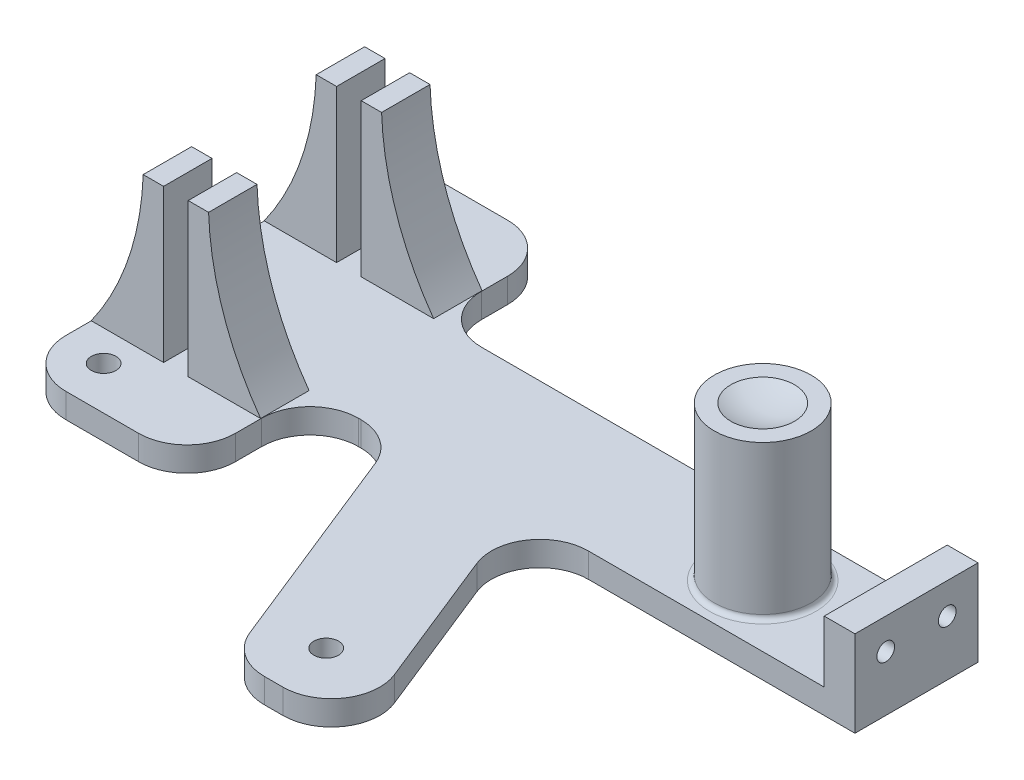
ISO-10303-21;
HEADER;
FILE_DESCRIPTION(('STEP AP214'),'2;1');
FILE_NAME('part.step','',(''),(''),'','','');
FILE_SCHEMA(('AUTOMOTIVE_DESIGN { 1 0 10303 214 1 1 1 1 }'));
ENDSEC;
DATA;
#1=APPLICATION_CONTEXT('core data for automotive mechanical design processes');
#2=APPLICATION_PROTOCOL_DEFINITION('international standard','automotive_design',2000,#1);
#3=PRODUCT_CONTEXT('',#1,'mechanical');
#4=PRODUCT('Part','Part','',(#3));
#5=PRODUCT_RELATED_PRODUCT_CATEGORY('part','',(#4));
#6=PRODUCT_DEFINITION_FORMATION('','',#4);
#7=PRODUCT_DEFINITION_CONTEXT('part definition',#1,'design');
#8=PRODUCT_DEFINITION('design','',#6,#7);
#9=PRODUCT_DEFINITION_SHAPE('','',#8);
#10=(LENGTH_UNIT() NAMED_UNIT(*) SI_UNIT(.MILLI.,.METRE.));
#11=(NAMED_UNIT(*) PLANE_ANGLE_UNIT() SI_UNIT($,.RADIAN.));
#12=(NAMED_UNIT(*) SI_UNIT($,.STERADIAN.) SOLID_ANGLE_UNIT());
#13=UNCERTAINTY_MEASURE_WITH_UNIT(LENGTH_MEASURE(1.E-05),#10,'distance_accuracy_value','');
#14=(GEOMETRIC_REPRESENTATION_CONTEXT(3) GLOBAL_UNCERTAINTY_ASSIGNED_CONTEXT((#13)) GLOBAL_UNIT_ASSIGNED_CONTEXT((#10,
#11,#12)) REPRESENTATION_CONTEXT('',''));
#15=CARTESIAN_POINT('',(0.,0.,0.));
#16=DIRECTION('',(0.,0.,1.));
#17=DIRECTION('',(1.,0.,0.));
#18=AXIS2_PLACEMENT_3D('',#15,#16,#17);
#19=CARTESIAN_POINT('',(30.08,-5.08,12.7));
#20=DIRECTION('',(0.,0.,1.));
#21=DIRECTION('',(1.,0.,0.));
#22=AXIS2_PLACEMENT_3D('',#19,#20,#21);
#23=PLANE('',#22);
#24=DIRECTION('',(1.,0.,0.));
#25=VECTOR('',#24,1.);
#26=CARTESIAN_POINT('',(30.08,0.,12.7));
#27=LINE('',#26,#25);
#28=CARTESIAN_POINT('',(77.5240703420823,0.,12.7));
#29=VERTEX_POINT('',#28);
#30=CARTESIAN_POINT('',(126.24,0.,12.7));
#31=VERTEX_POINT('',#30);
#32=EDGE_CURVE('E599',#29,#31,#27,.T.);
#33=ORIENTED_EDGE('',*,*,#32,.F.);
#34=DIRECTION('',(0.,1.,0.));
#35=VECTOR('',#34,1.);
#36=CARTESIAN_POINT('',(77.5240703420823,-5.08,12.7));
#37=LINE('',#36,#35);
#38=CARTESIAN_POINT('',(77.5240703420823,-5.08,12.7));
#39=VERTEX_POINT('',#38);
#40=EDGE_CURVE('E640',#29,#39,#37,.F.);
#41=ORIENTED_EDGE('',*,*,#40,.T.);
#42=DIRECTION('',(1.,0.,0.));
#43=VECTOR('',#42,1.);
#44=CARTESIAN_POINT('',(132.59,-5.08,12.7));
#45=LINE('',#44,#43);
#46=CARTESIAN_POINT('',(132.59,-5.08,12.7));
#47=VERTEX_POINT('',#46);
#48=EDGE_CURVE('E523',#39,#47,#45,.T.);
#49=ORIENTED_EDGE('',*,*,#48,.T.);
#50=DIRECTION('',(0.,1.,0.));
#51=VECTOR('',#50,1.);
#52=CARTESIAN_POINT('',(132.59,-5.08,12.7));
#53=LINE('',#52,#51);
#54=CARTESIAN_POINT('',(132.59,12.7,12.7));
#55=VERTEX_POINT('',#54);
#56=EDGE_CURVE('E560',#47,#55,#53,.T.);
#57=ORIENTED_EDGE('',*,*,#56,.T.);
#58=DIRECTION('',(1.,0.,0.));
#59=VECTOR('',#58,1.);
#60=CARTESIAN_POINT('',(132.59,12.7,12.7));
#61=LINE('',#60,#59);
#62=CARTESIAN_POINT('',(126.24,12.7,12.7));
#63=VERTEX_POINT('',#62);
#64=EDGE_CURVE('E370',#63,#55,#61,.T.);
#65=ORIENTED_EDGE('',*,*,#64,.F.);
#66=DIRECTION('',(0.,-1.,0.));
#67=VECTOR('',#66,1.);
#68=CARTESIAN_POINT('',(126.24,12.7,12.7));
#69=LINE('',#68,#67);
#70=EDGE_CURVE('E373',#63,#31,#69,.T.);
#71=ORIENTED_EDGE('',*,*,#70,.T.);
#72=EDGE_LOOP('',(#33,#41,#49,#57,#65,#71));
#73=FACE_BOUND('',#72,.T.);
#74=ADVANCED_FACE('F32',(#73),#23,.T.);
#75=CARTESIAN_POINT('',(30.08,0.,22.7));
#76=DIRECTION('',(0.,1.,0.));
#77=DIRECTION('',(0.,0.,1.));
#78=AXIS2_PLACEMENT_3D('',#75,#76,#77);
#79=PLANE('',#78);
#80=CARTESIAN_POINT('',(118.62,0.,0.));
#81=DIRECTION('',(0.,1.,0.));
#82=DIRECTION('',(0.,0.,1.));
#83=AXIS2_PLACEMENT_3D('',#80,#81,#82);
#84=CIRCLE('',#83,2.54);
#85=CARTESIAN_POINT('',(118.62,0.,2.54));
#86=VERTEX_POINT('',#85);
#87=EDGE_CURVE('E935',#86,#86,#84,.F.);
#88=ORIENTED_EDGE('',*,*,#87,.T.);
#89=EDGE_LOOP('',(#88));
#90=FACE_BOUND('',#89,.T.);
#91=CARTESIAN_POINT('',(67.8645239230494,0.,57.15));
#92=DIRECTION('',(0.,1.,0.));
#93=DIRECTION('',(0.,0.,1.));
#94=AXIS2_PLACEMENT_3D('',#91,#92,#93);
#95=CIRCLE('',#94,2.54);
#96=CARTESIAN_POINT('',(67.8645239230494,0.,59.69));
#97=VERTEX_POINT('',#96);
#98=EDGE_CURVE('E931',#97,#97,#95,.F.);
#99=ORIENTED_EDGE('',*,*,#98,.T.);
#100=EDGE_LOOP('',(#99));
#101=FACE_BOUND('',#100,.T.);
#102=CARTESIAN_POINT('',(-6.03,0.,-29.21));
#103=DIRECTION('',(0.,1.,0.));
#104=DIRECTION('',(0.,0.,1.));
#105=AXIS2_PLACEMENT_3D('',#102,#103,#104);
#106=CIRCLE('',#105,2.54);
#107=CARTESIAN_POINT('',(-6.03,0.,-26.67));
#108=VERTEX_POINT('',#107);
#109=EDGE_CURVE('E927',#108,#108,#106,.F.);
#110=ORIENTED_EDGE('',*,*,#109,.T.);
#111=EDGE_LOOP('',(#110));
#112=FACE_BOUND('',#111,.T.);
#113=CARTESIAN_POINT('',(-6.03,0.,29.21));
#114=DIRECTION('',(0.,1.,0.));
#115=DIRECTION('',(0.,0.,1.));
#116=AXIS2_PLACEMENT_3D('',#113,#114,#115);
#117=CIRCLE('',#116,2.54);
#118=CARTESIAN_POINT('',(-6.03,0.,31.75));
#119=VERTEX_POINT('',#118);
#120=EDGE_CURVE('E923',#119,#119,#117,.F.);
#121=ORIENTED_EDGE('',*,*,#120,.T.);
#122=EDGE_LOOP('',(#121));
#123=FACE_BOUND('',#122,.T.);
#124=CARTESIAN_POINT('',(100.84,0.,0.));
#125=DIRECTION('',(0.,1.,0.));
#126=DIRECTION('',(0.,0.,1.));
#127=AXIS2_PLACEMENT_3D('',#124,#125,#126);
#128=CIRCLE('',#127,11.);
#129=CARTESIAN_POINT('',(100.84,0.,11.));
#130=VERTEX_POINT('',#129);
#131=EDGE_CURVE('E634',#130,#130,#128,.F.);
#132=ORIENTED_EDGE('',*,*,#131,.T.);
#133=EDGE_LOOP('',(#132));
#134=FACE_BOUND('',#133,.T.);
#135=DIRECTION('',(0.,0.,1.));
#136=VECTOR('',#135,1.);
#137=CARTESIAN_POINT('',(5.08,0.,12.86));
#138=LINE('',#137,#136);
#139=CARTESIAN_POINT('',(5.08,0.,12.86));
#140=VERTEX_POINT('',#139);
#141=CARTESIAN_POINT('',(5.08,0.,22.86));
#142=VERTEX_POINT('',#141);
#143=EDGE_CURVE('E464',#140,#142,#138,.T.);
#144=ORIENTED_EDGE('',*,*,#143,.F.);
#145=DIRECTION('',(1.,0.,0.));
#146=VECTOR('',#145,1.);
#147=CARTESIAN_POINT('',(5.08,0.,12.86));
#148=LINE('',#147,#146);
#149=CARTESIAN_POINT('',(20.033299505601,0.,12.86));
#150=VERTEX_POINT('',#149);
#151=EDGE_CURVE('E455',#140,#150,#148,.T.);
#152=ORIENTED_EDGE('',*,*,#151,.T.);
#153=DIRECTION('',(0.,0.,1.));
#154=VECTOR('',#153,1.);
#155=CARTESIAN_POINT('',(20.033299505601,0.,12.86));
#156=LINE('',#155,#154);
#157=CARTESIAN_POINT('',(20.033299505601,0.,22.86));
#158=VERTEX_POINT('',#157);
#159=EDGE_CURVE('E480',#150,#158,#156,.T.);
#160=ORIENTED_EDGE('',*,*,#159,.T.);
#161=DIRECTION('',(1.,0.,0.));
#162=VECTOR('',#161,1.);
#163=CARTESIAN_POINT('',(5.08,0.,22.86));
#164=LINE('',#163,#162);
#165=EDGE_CURVE('E467',#142,#158,#164,.T.);
#166=ORIENTED_EDGE('',*,*,#165,.F.);
#167=EDGE_LOOP('',(#144,#152,#160,#166));
#168=FACE_BOUND('',#167,.T.);
#169=DIRECTION('',(0.,0.,-1.));
#170=VECTOR('',#169,1.);
#171=CARTESIAN_POINT('',(20.033299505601,0.,-12.86));
#172=LINE('',#171,#170);
#173=CARTESIAN_POINT('',(20.033299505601,0.,-12.86));
#174=VERTEX_POINT('',#173);
#175=CARTESIAN_POINT('',(20.033299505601,0.,-22.86));
#176=VERTEX_POINT('',#175);
#177=EDGE_CURVE('E410',#174,#176,#172,.T.);
#178=ORIENTED_EDGE('',*,*,#177,.F.);
#179=DIRECTION('',(1.,0.,0.));
#180=VECTOR('',#179,1.);
#181=CARTESIAN_POINT('',(5.08,0.,-12.86));
#182=LINE('',#181,#180);
#183=CARTESIAN_POINT('',(5.08,0.,-12.86));
#184=VERTEX_POINT('',#183);
#185=EDGE_CURVE('E396',#184,#174,#182,.T.);
#186=ORIENTED_EDGE('',*,*,#185,.F.);
#187=DIRECTION('',(0.,0.,-1.));
#188=VECTOR('',#187,1.);
#189=CARTESIAN_POINT('',(5.08,0.,-12.86));
#190=LINE('',#189,#188);
#191=CARTESIAN_POINT('',(5.08,0.,-22.86));
#192=VERTEX_POINT('',#191);
#193=EDGE_CURVE('E407',#184,#192,#190,.T.);
#194=ORIENTED_EDGE('',*,*,#193,.T.);
#195=DIRECTION('',(1.,0.,0.));
#196=VECTOR('',#195,1.);
#197=CARTESIAN_POINT('',(5.08,0.,-22.86));
#198=LINE('',#197,#196);
#199=EDGE_CURVE('E392',#192,#176,#198,.T.);
#200=ORIENTED_EDGE('',*,*,#199,.T.);
#201=EDGE_LOOP('',(#178,#186,#194,#200));
#202=FACE_BOUND('',#201,.T.);
#203=CARTESIAN_POINT('',(30.08,0.,12.7));
#204=VERTEX_POINT('',#203);
#205=CARTESIAN_POINT('',(30.5759629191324,0.,12.7));
#206=VERTEX_POINT('',#205);
#207=EDGE_CURVE('E600',#204,#206,#27,.T.);
#208=ORIENTED_EDGE('',*,*,#207,.T.);
#209=CARTESIAN_POINT('',(30.5759629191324,0.,22.7));
#210=DIRECTION('',(0.,1.,0.));
#211=DIRECTION('',(0.,0.,1.));
#212=AXIS2_PLACEMENT_3D('',#209,#210,#211);
#213=CIRCLE('',#212,10.);
#214=CARTESIAN_POINT('',(39.8575205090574,0.,18.9780799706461));
#215=VERTEX_POINT('',#214);
#216=EDGE_CURVE('E40',#206,#215,#213,.F.);
#217=ORIENTED_EDGE('',*,*,#216,.T.);
#218=DIRECTION('',(0.372192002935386,0.,0.928155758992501));
#219=VECTOR('',#218,1.);
#220=CARTESIAN_POINT('',(37.34,0.,12.7));
#221=LINE('',#220,#219);
#222=CARTESIAN_POINT('',(57.2304524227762,0.,62.3019200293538));
#223=VERTEX_POINT('',#222);
#224=EDGE_CURVE('E333',#215,#223,#221,.T.);
#225=ORIENTED_EDGE('',*,*,#224,.T.);
#226=CARTESIAN_POINT('',(66.5120100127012,0.,58.58));
#227=DIRECTION('',(0.,1.,0.));
#228=DIRECTION('',(0.,0.,1.));
#229=AXIS2_PLACEMENT_3D('',#226,#227,#228);
#230=CIRCLE('',#229,10.);
#231=CARTESIAN_POINT('',(66.5120100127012,0.,68.58));
#232=VERTEX_POINT('',#231);
#233=EDGE_CURVE('E315',#223,#232,#230,.T.);
#234=ORIENTED_EDGE('',*,*,#233,.T.);
#235=DIRECTION('',(1.,0.,0.));
#236=VECTOR('',#235,1.);
#237=CARTESIAN_POINT('',(70.3639025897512,0.,68.58));
#238=LINE('',#237,#236);
#239=CARTESIAN_POINT('',(70.3639025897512,0.,68.58));
#240=VERTEX_POINT('',#239);
#241=EDGE_CURVE('E337',#232,#240,#238,.T.);
#242=ORIENTED_EDGE('',*,*,#241,.T.);
#243=CARTESIAN_POINT('',(70.3639025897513,0.,58.58));
#244=DIRECTION('',(0.,1.,0.));
#245=DIRECTION('',(0.,0.,-1.));
#246=AXIS2_PLACEMENT_3D('',#243,#244,#245);
#247=CIRCLE('',#246,10.);
#248=CARTESIAN_POINT('',(79.6454601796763,0.,54.858079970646));
#249=VERTEX_POINT('',#248);
#250=EDGE_CURVE('E340',#240,#249,#247,.T.);
#251=ORIENTED_EDGE('',*,*,#250,.T.);
#252=DIRECTION('',(-0.372192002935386,0.,-0.928155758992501));
#253=VECTOR('',#252,1.);
#254=CARTESIAN_POINT('',(62.74,0.,12.7));
#255=LINE('',#254,#253);
#256=CARTESIAN_POINT('',(68.2425127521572,0.,26.4219200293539));
#257=VERTEX_POINT('',#256);
#258=EDGE_CURVE('E309',#249,#257,#255,.T.);
#259=ORIENTED_EDGE('',*,*,#258,.T.);
#260=CARTESIAN_POINT('',(77.5240703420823,0.,22.7));
#261=DIRECTION('',(0.,1.,0.));
#262=DIRECTION('',(0.,0.,1.));
#263=AXIS2_PLACEMENT_3D('',#260,#261,#262);
#264=CIRCLE('',#263,10.);
#265=EDGE_CURVE('E642',#257,#29,#264,.F.);
#266=ORIENTED_EDGE('',*,*,#265,.T.);
#267=ORIENTED_EDGE('',*,*,#32,.T.);
#268=DIRECTION('',(0.,0.,1.));
#269=VECTOR('',#268,1.);
#270=CARTESIAN_POINT('',(126.24,0.,12.7));
#271=LINE('',#270,#269);
#272=CARTESIAN_POINT('',(126.24,0.,-12.7));
#273=VERTEX_POINT('',#272);
#274=EDGE_CURVE('E362',#273,#31,#271,.T.);
#275=ORIENTED_EDGE('',*,*,#274,.F.);
#276=DIRECTION('',(-1.,0.,0.));
#277=VECTOR('',#276,1.);
#278=CARTESIAN_POINT('',(30.08,0.,-12.7));
#279=LINE('',#278,#277);
#280=CARTESIAN_POINT('',(30.08,0.,-12.7));
#281=VERTEX_POINT('',#280);
#282=EDGE_CURVE('E513',#273,#281,#279,.T.);
#283=ORIENTED_EDGE('',*,*,#282,.T.);
#284=CARTESIAN_POINT('',(30.08,0.,-22.7));
#285=DIRECTION('',(0.,-1.,0.));
#286=DIRECTION('',(0.,0.,1.));
#287=AXIS2_PLACEMENT_3D('',#284,#285,#286);
#288=CIRCLE('',#287,10.);
#289=CARTESIAN_POINT('',(20.08,0.,-22.7));
#290=VERTEX_POINT('',#289);
#291=EDGE_CURVE('E562',#281,#290,#288,.T.);
#292=ORIENTED_EDGE('',*,*,#291,.T.);
#293=DIRECTION('',(0.,0.,-1.));
#294=VECTOR('',#293,1.);
#295=CARTESIAN_POINT('',(20.08,0.,-28.1));
#296=LINE('',#295,#294);
#297=CARTESIAN_POINT('',(20.08,0.,-28.1));
#298=VERTEX_POINT('',#297);
#299=EDGE_CURVE('E565',#290,#298,#296,.T.);
#300=ORIENTED_EDGE('',*,*,#299,.T.);
#301=CARTESIAN_POINT('',(10.08,0.,-28.1));
#302=DIRECTION('',(0.,1.,0.));
#303=DIRECTION('',(0.,0.,1.));
#304=AXIS2_PLACEMENT_3D('',#301,#302,#303);
#305=CIRCLE('',#304,10.);
#306=CARTESIAN_POINT('',(10.08,0.,-38.1));
#307=VERTEX_POINT('',#306);
#308=EDGE_CURVE('E568',#298,#307,#305,.T.);
#309=ORIENTED_EDGE('',*,*,#308,.T.);
#310=DIRECTION('',(-1.,0.,0.));
#311=VECTOR('',#310,1.);
#312=CARTESIAN_POINT('',(-4.92,0.,-38.1));
#313=LINE('',#312,#311);
#314=CARTESIAN_POINT('',(-4.91999999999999,0.,-38.1));
#315=VERTEX_POINT('',#314);
#316=EDGE_CURVE('E571',#307,#315,#313,.T.);
#317=ORIENTED_EDGE('',*,*,#316,.T.);
#318=CARTESIAN_POINT('',(-4.92,0.,-28.1));
#319=DIRECTION('',(0.,1.,0.));
#320=DIRECTION('',(0.,0.,1.));
#321=AXIS2_PLACEMENT_3D('',#318,#319,#320);
#322=CIRCLE('',#321,10.);
#323=CARTESIAN_POINT('',(-14.92,0.,-28.1));
#324=VERTEX_POINT('',#323);
#325=EDGE_CURVE('E574',#315,#324,#322,.T.);
#326=ORIENTED_EDGE('',*,*,#325,.T.);
#327=DIRECTION('',(0.,0.,1.));
#328=VECTOR('',#327,1.);
#329=CARTESIAN_POINT('',(-14.92,0.,-28.1));
#330=LINE('',#329,#328);
#331=CARTESIAN_POINT('',(-14.92,0.,-22.86));
#332=VERTEX_POINT('',#331);
#333=EDGE_CURVE('E578',#324,#332,#330,.T.);
#334=ORIENTED_EDGE('',*,*,#333,.T.);
#335=DIRECTION('',(1.,0.,0.));
#336=VECTOR('',#335,1.);
#337=CARTESIAN_POINT('',(0.,0.,-22.86));
#338=LINE('',#337,#336);
#339=CARTESIAN_POINT('',(0.,0.,-22.86));
#340=VERTEX_POINT('',#339);
#341=EDGE_CURVE('E433',#332,#340,#338,.T.);
#342=ORIENTED_EDGE('',*,*,#341,.T.);
#343=DIRECTION('',(0.,0.,-1.));
#344=VECTOR('',#343,1.);
#345=CARTESIAN_POINT('',(0.,0.,-12.86));
#346=LINE('',#345,#344);
#347=CARTESIAN_POINT('',(0.,0.,-12.86));
#348=VERTEX_POINT('',#347);
#349=EDGE_CURVE('E430',#348,#340,#346,.T.);
#350=ORIENTED_EDGE('',*,*,#349,.F.);
#351=DIRECTION('',(1.,0.,0.));
#352=VECTOR('',#351,1.);
#353=CARTESIAN_POINT('',(0.,0.,-12.86));
#354=LINE('',#353,#352);
#355=CARTESIAN_POINT('',(-14.92,0.,-12.86));
#356=VERTEX_POINT('',#355);
#357=EDGE_CURVE('E421',#356,#348,#354,.T.);
#358=ORIENTED_EDGE('',*,*,#357,.F.);
#359=CARTESIAN_POINT('',(-14.92,0.,12.86));
#360=VERTEX_POINT('',#359);
#361=EDGE_CURVE('E583',#356,#360,#330,.T.);
#362=ORIENTED_EDGE('',*,*,#361,.T.);
#363=DIRECTION('',(1.,0.,0.));
#364=VECTOR('',#363,1.);
#365=CARTESIAN_POINT('',(0.,0.,12.86));
#366=LINE('',#365,#364);
#367=CARTESIAN_POINT('',(0.,0.,12.86));
#368=VERTEX_POINT('',#367);
#369=EDGE_CURVE('E498',#360,#368,#366,.T.);
#370=ORIENTED_EDGE('',*,*,#369,.T.);
#371=DIRECTION('',(0.,0.,1.));
#372=VECTOR('',#371,1.);
#373=CARTESIAN_POINT('',(0.,0.,12.86));
#374=LINE('',#373,#372);
#375=CARTESIAN_POINT('',(0.,0.,22.86));
#376=VERTEX_POINT('',#375);
#377=EDGE_CURVE('E510',#368,#376,#374,.T.);
#378=ORIENTED_EDGE('',*,*,#377,.T.);
#379=DIRECTION('',(1.,0.,0.));
#380=VECTOR('',#379,1.);
#381=CARTESIAN_POINT('',(0.,0.,22.86));
#382=LINE('',#381,#380);
#383=CARTESIAN_POINT('',(-14.92,0.,22.86));
#384=VERTEX_POINT('',#383);
#385=EDGE_CURVE('E509',#384,#376,#382,.T.);
#386=ORIENTED_EDGE('',*,*,#385,.F.);
#387=CARTESIAN_POINT('',(-14.92,0.,28.1));
#388=VERTEX_POINT('',#387);
#389=EDGE_CURVE('E577',#384,#388,#330,.T.);
#390=ORIENTED_EDGE('',*,*,#389,.T.);
#391=CARTESIAN_POINT('',(-4.92,0.,28.1));
#392=DIRECTION('',(0.,1.,0.));
#393=DIRECTION('',(0.,0.,1.));
#394=AXIS2_PLACEMENT_3D('',#391,#392,#393);
#395=CIRCLE('',#394,10.);
#396=CARTESIAN_POINT('',(-4.92,0.,38.1));
#397=VERTEX_POINT('',#396);
#398=EDGE_CURVE('E581',#388,#397,#395,.T.);
#399=ORIENTED_EDGE('',*,*,#398,.T.);
#400=DIRECTION('',(1.,0.,0.));
#401=VECTOR('',#400,1.);
#402=CARTESIAN_POINT('',(-4.92,0.,38.1));
#403=LINE('',#402,#401);
#404=CARTESIAN_POINT('',(10.08,0.,38.1));
#405=VERTEX_POINT('',#404);
#406=EDGE_CURVE('E587',#397,#405,#403,.T.);
#407=ORIENTED_EDGE('',*,*,#406,.T.);
#408=CARTESIAN_POINT('',(10.08,0.,28.1));
#409=DIRECTION('',(0.,1.,0.));
#410=DIRECTION('',(0.,0.,-1.));
#411=AXIS2_PLACEMENT_3D('',#408,#409,#410);
#412=CIRCLE('',#411,10.);
#413=CARTESIAN_POINT('',(20.08,0.,28.1));
#414=VERTEX_POINT('',#413);
#415=EDGE_CURVE('E590',#405,#414,#412,.T.);
#416=ORIENTED_EDGE('',*,*,#415,.T.);
#417=DIRECTION('',(0.,0.,-1.));
#418=VECTOR('',#417,1.);
#419=CARTESIAN_POINT('',(20.08,0.,28.1));
#420=LINE('',#419,#418);
#421=CARTESIAN_POINT('',(20.08,0.,22.7));
#422=VERTEX_POINT('',#421);
#423=EDGE_CURVE('E593',#414,#422,#420,.T.);
#424=ORIENTED_EDGE('',*,*,#423,.T.);
#425=CARTESIAN_POINT('',(30.08,0.,22.7));
#426=DIRECTION('',(0.,-1.,0.));
#427=DIRECTION('',(0.,0.,1.));
#428=AXIS2_PLACEMENT_3D('',#425,#426,#427);
#429=CIRCLE('',#428,10.);
#430=EDGE_CURVE('E596',#422,#204,#429,.T.);
#431=ORIENTED_EDGE('',*,*,#430,.T.);
#432=EDGE_LOOP('',(#208,#217,#225,#234,#242,#251,#259,#266,#267,#275,#283,#292,#300,#309,#317,
#326,#334,#342,#350,#358,#362,#370,#378,#386,#390,#399,#407,#416,#424,#431));
#433=FACE_BOUND('',#432,.T.);
#434=ADVANCED_FACE('F655',(#90,#101,#112,#123,#134,#168,#202,#433),#79,.T.);
#435=CARTESIAN_POINT('',(30.08,-5.08,12.7));
#436=VERTEX_POINT('',#435);
#437=CARTESIAN_POINT('',(30.5759629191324,-5.08,12.7));
#438=VERTEX_POINT('',#437);
#439=EDGE_CURVE('E519',#436,#438,#45,.T.);
#440=ORIENTED_EDGE('',*,*,#439,.T.);
#441=DIRECTION('',(0.,1.,0.));
#442=VECTOR('',#441,1.);
#443=CARTESIAN_POINT('',(30.5759629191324,0.,12.7));
#444=LINE('',#443,#442);
#445=EDGE_CURVE('E646',#438,#206,#444,.T.);
#446=ORIENTED_EDGE('',*,*,#445,.T.);
#447=ORIENTED_EDGE('',*,*,#207,.F.);
#448=DIRECTION('',(0.,1.,0.));
#449=VECTOR('',#448,1.);
#450=CARTESIAN_POINT('',(30.08,-5.08,12.7));
#451=LINE('',#450,#449);
#452=EDGE_CURVE('E602',#436,#204,#451,.T.);
#453=ORIENTED_EDGE('',*,*,#452,.F.);
#454=EDGE_LOOP('',(#440,#446,#447,#453));
#455=FACE_BOUND('',#454,.T.);
#456=ADVANCED_FACE('F652',(#455),#23,.T.);
#457=CARTESIAN_POINT('',(30.08,-5.08,22.7));
#458=DIRECTION('',(0.,1.,0.));
#459=DIRECTION('',(0.,0.,1.));
#460=AXIS2_PLACEMENT_3D('',#457,#458,#459);
#461=CYLINDRICAL_SURFACE('',#460,10.);
#462=ORIENTED_EDGE('',*,*,#430,.F.);
#463=DIRECTION('',(0.,1.,0.));
#464=VECTOR('',#463,1.);
#465=CARTESIAN_POINT('',(20.08,-5.08,22.7));
#466=LINE('',#465,#464);
#467=CARTESIAN_POINT('',(20.08,-5.08,22.7));
#468=VERTEX_POINT('',#467);
#469=EDGE_CURVE('E604',#468,#422,#466,.T.);
#470=ORIENTED_EDGE('',*,*,#469,.F.);
#471=CARTESIAN_POINT('',(30.08,-5.08,22.7));
#472=DIRECTION('',(0.,-1.,0.));
#473=DIRECTION('',(0.,0.,1.));
#474=AXIS2_PLACEMENT_3D('',#471,#472,#473);
#475=CIRCLE('',#474,10.);
#476=EDGE_CURVE('E557',#468,#436,#475,.T.);
#477=ORIENTED_EDGE('',*,*,#476,.T.);
#478=ORIENTED_EDGE('',*,*,#452,.T.);
#479=EDGE_LOOP('',(#462,#470,#477,#478));
#480=FACE_BOUND('',#479,.T.);
#481=ADVANCED_FACE('F659',(#480),#461,.F.);
#482=CARTESIAN_POINT('',(20.08,-5.08,28.1));
#483=DIRECTION('',(1.,0.,0.));
#484=DIRECTION('',(0.,0.,-1.));
#485=AXIS2_PLACEMENT_3D('',#482,#483,#484);
#486=PLANE('',#485);
#487=ORIENTED_EDGE('',*,*,#423,.F.);
#488=DIRECTION('',(0.,1.,0.));
#489=VECTOR('',#488,1.);
#490=CARTESIAN_POINT('',(20.08,-5.08,28.1));
#491=LINE('',#490,#489);
#492=CARTESIAN_POINT('',(20.08,-5.08,28.1));
#493=VERTEX_POINT('',#492);
#494=EDGE_CURVE('E606',#493,#414,#491,.T.);
#495=ORIENTED_EDGE('',*,*,#494,.F.);
#496=DIRECTION('',(0.,0.,-1.));
#497=VECTOR('',#496,1.);
#498=CARTESIAN_POINT('',(20.08,-5.08,28.1));
#499=LINE('',#498,#497);
#500=EDGE_CURVE('E554',#493,#468,#499,.T.);
#501=ORIENTED_EDGE('',*,*,#500,.T.);
#502=ORIENTED_EDGE('',*,*,#469,.T.);
#503=EDGE_LOOP('',(#487,#495,#501,#502));
#504=FACE_BOUND('',#503,.T.);
#505=ADVANCED_FACE('F664',(#504),#486,.T.);
#506=CARTESIAN_POINT('',(10.08,-5.08,28.1));
#507=DIRECTION('',(0.,1.,0.));
#508=DIRECTION('',(0.,0.,1.));
#509=AXIS2_PLACEMENT_3D('',#506,#507,#508);
#510=CYLINDRICAL_SURFACE('',#509,10.);
#511=ORIENTED_EDGE('',*,*,#415,.F.);
#512=DIRECTION('',(0.,1.,0.));
#513=VECTOR('',#512,1.);
#514=CARTESIAN_POINT('',(10.08,-5.08,38.1));
#515=LINE('',#514,#513);
#516=CARTESIAN_POINT('',(10.08,-5.08,38.1));
#517=VERTEX_POINT('',#516);
#518=EDGE_CURVE('E608',#517,#405,#515,.T.);
#519=ORIENTED_EDGE('',*,*,#518,.F.);
#520=CARTESIAN_POINT('',(10.08,-5.08,28.1));
#521=DIRECTION('',(0.,1.,0.));
#522=DIRECTION('',(0.,0.,-1.));
#523=AXIS2_PLACEMENT_3D('',#520,#521,#522);
#524=CIRCLE('',#523,10.);
#525=EDGE_CURVE('E551',#517,#493,#524,.T.);
#526=ORIENTED_EDGE('',*,*,#525,.T.);
#527=ORIENTED_EDGE('',*,*,#494,.T.);
#528=EDGE_LOOP('',(#511,#519,#526,#527));
#529=FACE_BOUND('',#528,.T.);
#530=ADVANCED_FACE('F667',(#529),#510,.T.);
#531=CARTESIAN_POINT('',(-4.92,-5.08,38.1));
#532=DIRECTION('',(0.,0.,1.));
#533=DIRECTION('',(1.,0.,0.));
#534=AXIS2_PLACEMENT_3D('',#531,#532,#533);
#535=PLANE('',#534);
#536=ORIENTED_EDGE('',*,*,#406,.F.);
#537=DIRECTION('',(0.,1.,0.));
#538=VECTOR('',#537,1.);
#539=CARTESIAN_POINT('',(-4.92,-5.08,38.1));
#540=LINE('',#539,#538);
#541=CARTESIAN_POINT('',(-4.92,-5.08,38.1));
#542=VERTEX_POINT('',#541);
#543=EDGE_CURVE('E610',#542,#397,#540,.T.);
#544=ORIENTED_EDGE('',*,*,#543,.F.);
#545=DIRECTION('',(1.,0.,0.));
#546=VECTOR('',#545,1.);
#547=CARTESIAN_POINT('',(-4.92,-5.08,38.1));
#548=LINE('',#547,#546);
#549=EDGE_CURVE('E548',#542,#517,#548,.T.);
#550=ORIENTED_EDGE('',*,*,#549,.T.);
#551=ORIENTED_EDGE('',*,*,#518,.T.);
#552=EDGE_LOOP('',(#536,#544,#550,#551));
#553=FACE_BOUND('',#552,.T.);
#554=ADVANCED_FACE('F672',(#553),#535,.T.);
#555=CARTESIAN_POINT('',(-4.92,-5.08,28.1));
#556=DIRECTION('',(0.,1.,0.));
#557=DIRECTION('',(0.,0.,1.));
#558=AXIS2_PLACEMENT_3D('',#555,#556,#557);
#559=CYLINDRICAL_SURFACE('',#558,10.);
#560=ORIENTED_EDGE('',*,*,#398,.F.);
#561=DIRECTION('',(0.,1.,0.));
#562=VECTOR('',#561,1.);
#563=CARTESIAN_POINT('',(-14.92,-5.08,28.1));
#564=LINE('',#563,#562);
#565=CARTESIAN_POINT('',(-14.92,-5.08,28.1));
#566=VERTEX_POINT('',#565);
#567=EDGE_CURVE('E612',#566,#388,#564,.T.);
#568=ORIENTED_EDGE('',*,*,#567,.F.);
#569=CARTESIAN_POINT('',(-4.92,-5.08,28.1));
#570=DIRECTION('',(0.,1.,0.));
#571=DIRECTION('',(0.,0.,1.));
#572=AXIS2_PLACEMENT_3D('',#569,#570,#571);
#573=CIRCLE('',#572,10.);
#574=EDGE_CURVE('E545',#566,#542,#573,.T.);
#575=ORIENTED_EDGE('',*,*,#574,.T.);
#576=ORIENTED_EDGE('',*,*,#543,.T.);
#577=EDGE_LOOP('',(#560,#568,#575,#576));
#578=FACE_BOUND('',#577,.T.);
#579=ADVANCED_FACE('F675',(#578),#559,.T.);
#580=CARTESIAN_POINT('',(-14.92,-5.08,-28.1));
#581=DIRECTION('',(-1.,0.,0.));
#582=DIRECTION('',(0.,0.,1.));
#583=AXIS2_PLACEMENT_3D('',#580,#581,#582);
#584=PLANE('',#583);
#585=ORIENTED_EDGE('',*,*,#333,.F.);
#586=DIRECTION('',(0.,1.,0.));
#587=VECTOR('',#586,1.);
#588=CARTESIAN_POINT('',(-14.92,-5.08,-28.1));
#589=LINE('',#588,#587);
#590=CARTESIAN_POINT('',(-14.92,-5.08,-28.1));
#591=VERTEX_POINT('',#590);
#592=EDGE_CURVE('E615',#591,#324,#589,.T.);
#593=ORIENTED_EDGE('',*,*,#592,.F.);
#594=DIRECTION('',(0.,0.,1.));
#595=VECTOR('',#594,1.);
#596=CARTESIAN_POINT('',(-14.92,-5.08,-28.1));
#597=LINE('',#596,#595);
#598=EDGE_CURVE('E542',#591,#566,#597,.T.);
#599=ORIENTED_EDGE('',*,*,#598,.T.);
#600=ORIENTED_EDGE('',*,*,#567,.T.);
#601=ORIENTED_EDGE('',*,*,#389,.F.);
#602=EDGE_CURVE('E584',#360,#384,#330,.T.);
#603=ORIENTED_EDGE('',*,*,#602,.F.);
#604=ORIENTED_EDGE('',*,*,#361,.F.);
#605=EDGE_CURVE('E582',#332,#356,#330,.T.);
#606=ORIENTED_EDGE('',*,*,#605,.F.);
#607=EDGE_LOOP('',(#585,#593,#599,#600,#601,#603,#604,#606));
#608=FACE_BOUND('',#607,.T.);
#609=ADVANCED_FACE('F680',(#608),#584,.T.);
#610=CARTESIAN_POINT('',(-4.92,-5.08,-28.1));
#611=DIRECTION('',(0.,1.,0.));
#612=DIRECTION('',(0.,0.,1.));
#613=AXIS2_PLACEMENT_3D('',#610,#611,#612);
#614=CYLINDRICAL_SURFACE('',#613,10.);
#615=ORIENTED_EDGE('',*,*,#325,.F.);
#616=DIRECTION('',(0.,1.,0.));
#617=VECTOR('',#616,1.);
#618=CARTESIAN_POINT('',(-4.91999999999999,-5.08,-38.1));
#619=LINE('',#618,#617);
#620=CARTESIAN_POINT('',(-4.91999999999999,-5.08,-38.1));
#621=VERTEX_POINT('',#620);
#622=EDGE_CURVE('E617',#621,#315,#619,.T.);
#623=ORIENTED_EDGE('',*,*,#622,.F.);
#624=CARTESIAN_POINT('',(-4.92,-5.08,-28.1));
#625=DIRECTION('',(0.,1.,0.));
#626=DIRECTION('',(0.,0.,1.));
#627=AXIS2_PLACEMENT_3D('',#624,#625,#626);
#628=CIRCLE('',#627,10.);
#629=EDGE_CURVE('E539',#621,#591,#628,.T.);
#630=ORIENTED_EDGE('',*,*,#629,.T.);
#631=ORIENTED_EDGE('',*,*,#592,.T.);
#632=EDGE_LOOP('',(#615,#623,#630,#631));
#633=FACE_BOUND('',#632,.T.);
#634=ADVANCED_FACE('F684',(#633),#614,.T.);
#635=CARTESIAN_POINT('',(-4.92,-5.08,-38.1));
#636=DIRECTION('',(0.,0.,-1.));
#637=DIRECTION('',(-1.,0.,0.));
#638=AXIS2_PLACEMENT_3D('',#635,#636,#637);
#639=PLANE('',#638);
#640=ORIENTED_EDGE('',*,*,#316,.F.);
#641=DIRECTION('',(0.,1.,0.));
#642=VECTOR('',#641,1.);
#643=CARTESIAN_POINT('',(10.08,-5.08,-38.1));
#644=LINE('',#643,#642);
#645=CARTESIAN_POINT('',(10.08,-5.08,-38.1));
#646=VERTEX_POINT('',#645);
#647=EDGE_CURVE('E619',#646,#307,#644,.T.);
#648=ORIENTED_EDGE('',*,*,#647,.F.);
#649=DIRECTION('',(-1.,0.,0.));
#650=VECTOR('',#649,1.);
#651=CARTESIAN_POINT('',(-4.92,-5.08,-38.1));
#652=LINE('',#651,#650);
#653=EDGE_CURVE('E536',#646,#621,#652,.T.);
#654=ORIENTED_EDGE('',*,*,#653,.T.);
#655=ORIENTED_EDGE('',*,*,#622,.T.);
#656=EDGE_LOOP('',(#640,#648,#654,#655));
#657=FACE_BOUND('',#656,.T.);
#658=ADVANCED_FACE('F689',(#657),#639,.T.);
#659=CARTESIAN_POINT('',(10.08,-5.08,-28.1));
#660=DIRECTION('',(0.,1.,0.));
#661=DIRECTION('',(0.,0.,1.));
#662=AXIS2_PLACEMENT_3D('',#659,#660,#661);
#663=CYLINDRICAL_SURFACE('',#662,10.);
#664=ORIENTED_EDGE('',*,*,#308,.F.);
#665=DIRECTION('',(0.,1.,0.));
#666=VECTOR('',#665,1.);
#667=CARTESIAN_POINT('',(20.08,-5.08,-28.1));
#668=LINE('',#667,#666);
#669=CARTESIAN_POINT('',(20.08,-5.08,-28.1));
#670=VERTEX_POINT('',#669);
#671=EDGE_CURVE('E621',#670,#298,#668,.T.);
#672=ORIENTED_EDGE('',*,*,#671,.F.);
#673=CARTESIAN_POINT('',(10.08,-5.08,-28.1));
#674=DIRECTION('',(0.,1.,0.));
#675=DIRECTION('',(0.,0.,1.));
#676=AXIS2_PLACEMENT_3D('',#673,#674,#675);
#677=CIRCLE('',#676,10.);
#678=EDGE_CURVE('E533',#670,#646,#677,.T.);
#679=ORIENTED_EDGE('',*,*,#678,.T.);
#680=ORIENTED_EDGE('',*,*,#647,.T.);
#681=EDGE_LOOP('',(#664,#672,#679,#680));
#682=FACE_BOUND('',#681,.T.);
#683=ADVANCED_FACE('F692',(#682),#663,.T.);
#684=CARTESIAN_POINT('',(20.08,-5.08,-28.1));
#685=DIRECTION('',(1.,0.,0.));
#686=DIRECTION('',(0.,0.,-1.));
#687=AXIS2_PLACEMENT_3D('',#684,#685,#686);
#688=PLANE('',#687);
#689=ORIENTED_EDGE('',*,*,#299,.F.);
#690=DIRECTION('',(0.,1.,0.));
#691=VECTOR('',#690,1.);
#692=CARTESIAN_POINT('',(20.08,-5.08,-22.7));
#693=LINE('',#692,#691);
#694=CARTESIAN_POINT('',(20.08,-5.08,-22.7));
#695=VERTEX_POINT('',#694);
#696=EDGE_CURVE('E623',#695,#290,#693,.T.);
#697=ORIENTED_EDGE('',*,*,#696,.F.);
#698=DIRECTION('',(0.,0.,-1.));
#699=VECTOR('',#698,1.);
#700=CARTESIAN_POINT('',(20.08,-5.08,-28.1));
#701=LINE('',#700,#699);
#702=EDGE_CURVE('E530',#695,#670,#701,.T.);
#703=ORIENTED_EDGE('',*,*,#702,.T.);
#704=ORIENTED_EDGE('',*,*,#671,.T.);
#705=EDGE_LOOP('',(#689,#697,#703,#704));
#706=FACE_BOUND('',#705,.T.);
#707=ADVANCED_FACE('F697',(#706),#688,.T.);
#708=CARTESIAN_POINT('',(30.08,-5.08,-22.7));
#709=DIRECTION('',(0.,1.,0.));
#710=DIRECTION('',(0.,0.,1.));
#711=AXIS2_PLACEMENT_3D('',#708,#709,#710);
#712=CYLINDRICAL_SURFACE('',#711,10.);
#713=ORIENTED_EDGE('',*,*,#291,.F.);
#714=DIRECTION('',(0.,1.,0.));
#715=VECTOR('',#714,1.);
#716=CARTESIAN_POINT('',(30.08,-5.08,-12.7));
#717=LINE('',#716,#715);
#718=CARTESIAN_POINT('',(30.08,-5.08,-12.7));
#719=VERTEX_POINT('',#718);
#720=EDGE_CURVE('E625',#719,#281,#717,.T.);
#721=ORIENTED_EDGE('',*,*,#720,.F.);
#722=CARTESIAN_POINT('',(30.08,-5.08,-22.7));
#723=DIRECTION('',(0.,-1.,0.));
#724=DIRECTION('',(0.,0.,1.));
#725=AXIS2_PLACEMENT_3D('',#722,#723,#724);
#726=CIRCLE('',#725,10.);
#727=EDGE_CURVE('E527',#719,#695,#726,.T.);
#728=ORIENTED_EDGE('',*,*,#727,.T.);
#729=ORIENTED_EDGE('',*,*,#696,.T.);
#730=EDGE_LOOP('',(#713,#721,#728,#729));
#731=FACE_BOUND('',#730,.T.);
#732=ADVANCED_FACE('F700',(#731),#712,.F.);
#733=CARTESIAN_POINT('',(30.08,-5.08,-12.7));
#734=DIRECTION('',(0.,0.,-1.));
#735=DIRECTION('',(-1.,0.,0.));
#736=AXIS2_PLACEMENT_3D('',#733,#734,#735);
#737=PLANE('',#736);
#738=ORIENTED_EDGE('',*,*,#282,.F.);
#739=DIRECTION('',(0.,-1.,0.));
#740=VECTOR('',#739,1.);
#741=CARTESIAN_POINT('',(126.24,12.7,-12.7));
#742=LINE('',#741,#740);
#743=CARTESIAN_POINT('',(126.24,12.7,-12.7));
#744=VERTEX_POINT('',#743);
#745=EDGE_CURVE('E378',#744,#273,#742,.T.);
#746=ORIENTED_EDGE('',*,*,#745,.F.);
#747=DIRECTION('',(-1.,0.,0.));
#748=VECTOR('',#747,1.);
#749=CARTESIAN_POINT('',(132.59,12.7,-12.7));
#750=LINE('',#749,#748);
#751=CARTESIAN_POINT('',(132.59,12.7,-12.7));
#752=VERTEX_POINT('',#751);
#753=EDGE_CURVE('E366',#752,#744,#750,.T.);
#754=ORIENTED_EDGE('',*,*,#753,.F.);
#755=DIRECTION('',(0.,1.,0.));
#756=VECTOR('',#755,1.);
#757=CARTESIAN_POINT('',(132.59,-5.08,-12.7));
#758=LINE('',#757,#756);
#759=CARTESIAN_POINT('',(132.59,-5.08,-12.7));
#760=VERTEX_POINT('',#759);
#761=EDGE_CURVE('E628',#760,#752,#758,.T.);
#762=ORIENTED_EDGE('',*,*,#761,.F.);
#763=DIRECTION('',(-1.,0.,0.));
#764=VECTOR('',#763,1.);
#765=CARTESIAN_POINT('',(132.59,-5.08,-12.7));
#766=LINE('',#765,#764);
#767=EDGE_CURVE('E525',#760,#719,#766,.T.);
#768=ORIENTED_EDGE('',*,*,#767,.T.);
#769=ORIENTED_EDGE('',*,*,#720,.T.);
#770=EDGE_LOOP('',(#738,#746,#754,#762,#768,#769));
#771=FACE_BOUND('',#770,.T.);
#772=ADVANCED_FACE('F708',(#771),#737,.T.);
#773=CARTESIAN_POINT('',(132.59,-5.08,0.));
#774=DIRECTION('',(1.,0.,0.));
#775=DIRECTION('',(0.,0.,-1.));
#776=AXIS2_PLACEMENT_3D('',#773,#774,#775);
#777=PLANE('',#776);
#778=CARTESIAN_POINT('',(132.59,6.35,-6.35));
#779=DIRECTION('',(1.,0.,0.));
#780=DIRECTION('',(0.,0.,-1.));
#781=AXIS2_PLACEMENT_3D('',#778,#779,#780);
#782=CIRCLE('',#781,1.8288);
#783=CARTESIAN_POINT('',(132.59,6.35,-8.1788));
#784=VERTEX_POINT('',#783);
#785=EDGE_CURVE('E347',#784,#784,#782,.T.);
#786=ORIENTED_EDGE('',*,*,#785,.F.);
#787=EDGE_LOOP('',(#786));
#788=FACE_BOUND('',#787,.T.);
#789=CARTESIAN_POINT('',(132.59,6.35,6.35));
#790=DIRECTION('',(1.,0.,0.));
#791=DIRECTION('',(0.,0.,-1.));
#792=AXIS2_PLACEMENT_3D('',#789,#790,#791);
#793=CIRCLE('',#792,1.8288);
#794=CARTESIAN_POINT('',(132.59,6.35,4.5212));
#795=VERTEX_POINT('',#794);
#796=EDGE_CURVE('E356',#795,#795,#793,.T.);
#797=ORIENTED_EDGE('',*,*,#796,.F.);
#798=EDGE_LOOP('',(#797));
#799=FACE_BOUND('',#798,.T.);
#800=ORIENTED_EDGE('',*,*,#761,.T.);
#801=DIRECTION('',(0.,0.,-1.));
#802=VECTOR('',#801,1.);
#803=CARTESIAN_POINT('',(132.59,12.7,12.7));
#804=LINE('',#803,#802);
#805=EDGE_CURVE('E363',#55,#752,#804,.T.);
#806=ORIENTED_EDGE('',*,*,#805,.F.);
#807=ORIENTED_EDGE('',*,*,#56,.F.);
#808=DIRECTION('',(0.,0.,-1.));
#809=VECTOR('',#808,1.);
#810=CARTESIAN_POINT('',(132.59,-5.08,0.));
#811=LINE('',#810,#809);
#812=EDGE_CURVE('E522',#47,#760,#811,.T.);
#813=ORIENTED_EDGE('',*,*,#812,.T.);
#814=EDGE_LOOP('',(#800,#806,#807,#813));
#815=FACE_BOUND('',#814,.T.);
#816=ADVANCED_FACE('F713',(#788,#799,#815),#777,.T.);
#817=CARTESIAN_POINT('',(30.08,-5.08,22.7));
#818=DIRECTION('',(0.,1.,0.));
#819=DIRECTION('',(0.,0.,1.));
#820=AXIS2_PLACEMENT_3D('',#817,#818,#819);
#821=PLANE('',#820);
#822=CARTESIAN_POINT('',(118.62,-5.08,0.));
#823=DIRECTION('',(0.,-1.,0.));
#824=DIRECTION('',(0.,0.,-1.));
#825=AXIS2_PLACEMENT_3D('',#822,#823,#824);
#826=CIRCLE('',#825,2.54);
#827=CARTESIAN_POINT('',(118.62,-5.08,-2.54));
#828=VERTEX_POINT('',#827);
#829=EDGE_CURVE('E911',#828,#828,#826,.T.);
#830=ORIENTED_EDGE('',*,*,#829,.F.);
#831=EDGE_LOOP('',(#830));
#832=FACE_BOUND('',#831,.T.);
#833=CARTESIAN_POINT('',(67.8645239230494,-5.08,57.15));
#834=DIRECTION('',(0.,-1.,0.));
#835=DIRECTION('',(0.,0.,-1.));
#836=AXIS2_PLACEMENT_3D('',#833,#834,#835);
#837=CIRCLE('',#836,2.54);
#838=CARTESIAN_POINT('',(67.8645239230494,-5.08,54.61));
#839=VERTEX_POINT('',#838);
#840=EDGE_CURVE('E915',#839,#839,#837,.T.);
#841=ORIENTED_EDGE('',*,*,#840,.F.);
#842=EDGE_LOOP('',(#841));
#843=FACE_BOUND('',#842,.T.);
#844=CARTESIAN_POINT('',(-6.03,-5.08,-29.21));
#845=DIRECTION('',(0.,-1.,0.));
#846=DIRECTION('',(0.,0.,1.));
#847=AXIS2_PLACEMENT_3D('',#844,#845,#846);
#848=CIRCLE('',#847,2.54);
#849=CARTESIAN_POINT('',(-6.03,-5.08,-26.67));
#850=VERTEX_POINT('',#849);
#851=EDGE_CURVE('E919',#850,#850,#848,.T.);
#852=ORIENTED_EDGE('',*,*,#851,.F.);
#853=EDGE_LOOP('',(#852));
#854=FACE_BOUND('',#853,.T.);
#855=CARTESIAN_POINT('',(-6.03,-5.08,29.21));
#856=DIRECTION('',(0.,-1.,0.));
#857=DIRECTION('',(0.,0.,-1.));
#858=AXIS2_PLACEMENT_3D('',#855,#856,#857);
#859=CIRCLE('',#858,2.54);
#860=CARTESIAN_POINT('',(-6.03,-5.08,26.67));
#861=VERTEX_POINT('',#860);
#862=EDGE_CURVE('E335',#861,#861,#859,.T.);
#863=ORIENTED_EDGE('',*,*,#862,.F.);
#864=EDGE_LOOP('',(#863));
#865=FACE_BOUND('',#864,.T.);
#866=ORIENTED_EDGE('',*,*,#439,.F.);
#867=ORIENTED_EDGE('',*,*,#476,.F.);
#868=ORIENTED_EDGE('',*,*,#500,.F.);
#869=ORIENTED_EDGE('',*,*,#525,.F.);
#870=ORIENTED_EDGE('',*,*,#549,.F.);
#871=ORIENTED_EDGE('',*,*,#574,.F.);
#872=ORIENTED_EDGE('',*,*,#598,.F.);
#873=ORIENTED_EDGE('',*,*,#629,.F.);
#874=ORIENTED_EDGE('',*,*,#653,.F.);
#875=ORIENTED_EDGE('',*,*,#678,.F.);
#876=ORIENTED_EDGE('',*,*,#702,.F.);
#877=ORIENTED_EDGE('',*,*,#727,.F.);
#878=ORIENTED_EDGE('',*,*,#767,.F.);
#879=ORIENTED_EDGE('',*,*,#812,.F.);
#880=ORIENTED_EDGE('',*,*,#48,.F.);
#881=CARTESIAN_POINT('',(77.5240703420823,-5.08,22.7));
#882=DIRECTION('',(0.,1.,0.));
#883=DIRECTION('',(0.,0.,1.));
#884=AXIS2_PLACEMENT_3D('',#881,#882,#883);
#885=CIRCLE('',#884,10.);
#886=CARTESIAN_POINT('',(68.2425127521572,-5.08,26.4219200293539));
#887=VERTEX_POINT('',#886);
#888=EDGE_CURVE('E644',#39,#887,#885,.T.);
#889=ORIENTED_EDGE('',*,*,#888,.T.);
#890=DIRECTION('',(-0.372192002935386,0.,-0.928155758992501));
#891=VECTOR('',#890,1.);
#892=CARTESIAN_POINT('',(62.74,-5.08,12.7));
#893=LINE('',#892,#891);
#894=CARTESIAN_POINT('',(79.6454601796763,-5.08,54.858079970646));
#895=VERTEX_POINT('',#894);
#896=EDGE_CURVE('E317',#895,#887,#893,.T.);
#897=ORIENTED_EDGE('',*,*,#896,.F.);
#898=CARTESIAN_POINT('',(70.3639025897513,-5.08,58.58));
#899=DIRECTION('',(0.,1.,0.));
#900=DIRECTION('',(0.,0.,-1.));
#901=AXIS2_PLACEMENT_3D('',#898,#899,#900);
#902=CIRCLE('',#901,10.);
#903=CARTESIAN_POINT('',(70.3639025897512,-5.08,68.58));
#904=VERTEX_POINT('',#903);
#905=EDGE_CURVE('E325',#904,#895,#902,.T.);
#906=ORIENTED_EDGE('',*,*,#905,.F.);
#907=DIRECTION('',(1.,0.,0.));
#908=VECTOR('',#907,1.);
#909=CARTESIAN_POINT('',(70.3639025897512,-5.08,68.58));
#910=LINE('',#909,#908);
#911=CARTESIAN_POINT('',(66.5120100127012,-5.08,68.58));
#912=VERTEX_POINT('',#911);
#913=EDGE_CURVE('E323',#912,#904,#910,.T.);
#914=ORIENTED_EDGE('',*,*,#913,.F.);
#915=CARTESIAN_POINT('',(66.5120100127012,-5.08,58.58));
#916=DIRECTION('',(0.,1.,0.));
#917=DIRECTION('',(0.,0.,1.));
#918=AXIS2_PLACEMENT_3D('',#915,#916,#917);
#919=CIRCLE('',#918,10.);
#920=CARTESIAN_POINT('',(57.2304524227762,-5.08,62.3019200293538));
#921=VERTEX_POINT('',#920);
#922=EDGE_CURVE('E308',#921,#912,#919,.T.);
#923=ORIENTED_EDGE('',*,*,#922,.F.);
#924=DIRECTION('',(0.372192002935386,0.,0.928155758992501));
#925=VECTOR('',#924,1.);
#926=CARTESIAN_POINT('',(37.34,-5.08,12.7));
#927=LINE('',#926,#925);
#928=CARTESIAN_POINT('',(39.8575205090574,-5.08,18.9780799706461));
#929=VERTEX_POINT('',#928);
#930=EDGE_CURVE('E300',#929,#921,#927,.T.);
#931=ORIENTED_EDGE('',*,*,#930,.F.);
#932=CARTESIAN_POINT('',(30.5759629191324,-5.08,22.7));
#933=DIRECTION('',(0.,1.,0.));
#934=DIRECTION('',(0.,0.,1.));
#935=AXIS2_PLACEMENT_3D('',#932,#933,#934);
#936=CIRCLE('',#935,10.);
#937=EDGE_CURVE('E11',#929,#438,#936,.T.);
#938=ORIENTED_EDGE('',*,*,#937,.T.);
#939=EDGE_LOOP('',(#866,#867,#868,#869,#870,#871,#872,#873,#874,#875,#876,#877,#878,#879,#880,
#889,#897,#906,#914,#923,#931,#938));
#940=FACE_BOUND('',#939,.T.);
#941=ADVANCED_FACE('F320',(#832,#843,#854,#865,#940),#821,.F.);
#942=CARTESIAN_POINT('',(0.,0.,12.86));
#943=DIRECTION('',(1.,0.,0.));
#944=DIRECTION('',(0.,0.,-1.));
#945=AXIS2_PLACEMENT_3D('',#942,#943,#944);
#946=PLANE('',#945);
#947=DIRECTION('',(0.,1.,0.));
#948=VECTOR('',#947,1.);
#949=CARTESIAN_POINT('',(0.,0.,22.86));
#950=LINE('',#949,#948);
#951=CARTESIAN_POINT('',(0.,31.5,22.86));
#952=VERTEX_POINT('',#951);
#953=EDGE_CURVE('E477',#376,#952,#950,.T.);
#954=ORIENTED_EDGE('',*,*,#953,.F.);
#955=ORIENTED_EDGE('',*,*,#377,.F.);
#956=DIRECTION('',(0.,1.,0.));
#957=VECTOR('',#956,1.);
#958=CARTESIAN_POINT('',(0.,0.,12.86));
#959=LINE('',#958,#957);
#960=CARTESIAN_POINT('',(0.,31.5,12.86));
#961=VERTEX_POINT('',#960);
#962=EDGE_CURVE('E484',#368,#961,#959,.T.);
#963=ORIENTED_EDGE('',*,*,#962,.T.);
#964=DIRECTION('',(0.,0.,1.));
#965=VECTOR('',#964,1.);
#966=CARTESIAN_POINT('',(0.,31.5,12.86));
#967=LINE('',#966,#965);
#968=EDGE_CURVE('E497',#961,#952,#967,.T.);
#969=ORIENTED_EDGE('',*,*,#968,.T.);
#970=EDGE_LOOP('',(#954,#955,#963,#969));
#971=FACE_BOUND('',#970,.T.);
#972=ADVANCED_FACE('F892',(#971),#946,.T.);
#973=CARTESIAN_POINT('',(0.,0.,12.86));
#974=DIRECTION('',(0.,-1.,0.));
#975=DIRECTION('',(0.,0.,-1.));
#976=AXIS2_PLACEMENT_3D('',#973,#974,#975);
#977=PLANE('',#976);
#978=CARTESIAN_POINT('',(-14.953299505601,0.,12.86));
#979=VERTEX_POINT('',#978);
#980=EDGE_CURVE('E494',#979,#360,#366,.T.);
#981=ORIENTED_EDGE('',*,*,#980,.T.);
#982=ORIENTED_EDGE('',*,*,#602,.T.);
#983=CARTESIAN_POINT('',(-14.953299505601,0.,22.86));
#984=VERTEX_POINT('',#983);
#985=EDGE_CURVE('E488',#984,#384,#382,.T.);
#986=ORIENTED_EDGE('',*,*,#985,.F.);
#987=DIRECTION('',(0.,0.,1.));
#988=VECTOR('',#987,1.);
#989=CARTESIAN_POINT('',(-14.953299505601,0.,12.86));
#990=LINE('',#989,#988);
#991=EDGE_CURVE('E514',#979,#984,#990,.T.);
#992=ORIENTED_EDGE('',*,*,#991,.F.);
#993=EDGE_LOOP('',(#981,#982,#986,#992));
#994=FACE_BOUND('',#993,.T.);
#995=ADVANCED_FACE('F888',(#994),#977,.T.);
#996=CARTESIAN_POINT('',(-61.7361496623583,33.5385721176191,12.86));
#997=DIRECTION('',(0.,0.,1.));
#998=DIRECTION('',(1.,0.,0.));
#999=AXIS2_PLACEMENT_3D('',#996,#997,#998);
#1000=CYLINDRICAL_SURFACE('',#999,57.5627560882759);
#1001=CARTESIAN_POINT('',(-61.7361496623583,33.5385721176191,22.86));
#1002=DIRECTION('',(0.,0.,-1.));
#1003=DIRECTION('',(-1.,0.,0.));
#1004=AXIS2_PLACEMENT_3D('',#1001,#1002,#1003);
#1005=CIRCLE('',#1004,57.5627560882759);
#1006=CARTESIAN_POINT('',(-4.20950268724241,31.5,22.86));
#1007=VERTEX_POINT('',#1006);
#1008=EDGE_CURVE('E504',#1007,#984,#1005,.T.);
#1009=ORIENTED_EDGE('',*,*,#1008,.F.);
#1010=DIRECTION('',(0.,0.,1.));
#1011=VECTOR('',#1010,1.);
#1012=CARTESIAN_POINT('',(-4.20950268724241,31.5,12.86));
#1013=LINE('',#1012,#1011);
#1014=CARTESIAN_POINT('',(-4.20950268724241,31.5,12.86));
#1015=VERTEX_POINT('',#1014);
#1016=EDGE_CURVE('E516',#1015,#1007,#1013,.T.);
#1017=ORIENTED_EDGE('',*,*,#1016,.F.);
#1018=CARTESIAN_POINT('',(-61.7361496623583,33.5385721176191,12.86));
#1019=DIRECTION('',(0.,0.,-1.));
#1020=DIRECTION('',(-1.,0.,0.));
#1021=AXIS2_PLACEMENT_3D('',#1018,#1019,#1020);
#1022=CIRCLE('',#1021,57.5627560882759);
#1023=EDGE_CURVE('E491',#1015,#979,#1022,.T.);
#1024=ORIENTED_EDGE('',*,*,#1023,.T.);
#1025=ORIENTED_EDGE('',*,*,#991,.T.);
#1026=EDGE_LOOP('',(#1009,#1017,#1024,#1025));
#1027=FACE_BOUND('',#1026,.T.);
#1028=ADVANCED_FACE('F891',(#1027),#1000,.F.);
#1029=CARTESIAN_POINT('',(0.,31.5,12.86));
#1030=DIRECTION('',(0.,1.,0.));
#1031=DIRECTION('',(0.,0.,1.));
#1032=AXIS2_PLACEMENT_3D('',#1029,#1030,#1031);
#1033=PLANE('',#1032);
#1034=DIRECTION('',(-1.,0.,0.));
#1035=VECTOR('',#1034,1.);
#1036=CARTESIAN_POINT('',(0.,31.5,22.86));
#1037=LINE('',#1036,#1035);
#1038=EDGE_CURVE('E501',#952,#1007,#1037,.T.);
#1039=ORIENTED_EDGE('',*,*,#1038,.F.);
#1040=ORIENTED_EDGE('',*,*,#968,.F.);
#1041=DIRECTION('',(-1.,0.,0.));
#1042=VECTOR('',#1041,1.);
#1043=CARTESIAN_POINT('',(0.,31.5,12.86));
#1044=LINE('',#1043,#1042);
#1045=EDGE_CURVE('E487',#961,#1015,#1044,.T.);
#1046=ORIENTED_EDGE('',*,*,#1045,.T.);
#1047=ORIENTED_EDGE('',*,*,#1016,.T.);
#1048=EDGE_LOOP('',(#1039,#1040,#1046,#1047));
#1049=FACE_BOUND('',#1048,.T.);
#1050=ADVANCED_FACE('F883',(#1049),#1033,.T.);
#1051=CARTESIAN_POINT('',(-61.7361496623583,33.5385721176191,12.86));
#1052=DIRECTION('',(0.,0.,-1.));
#1053=DIRECTION('',(-1.,0.,0.));
#1054=AXIS2_PLACEMENT_3D('',#1051,#1052,#1053);
#1055=PLANE('',#1054);
#1056=ORIENTED_EDGE('',*,*,#962,.F.);
#1057=ORIENTED_EDGE('',*,*,#369,.F.);
#1058=ORIENTED_EDGE('',*,*,#980,.F.);
#1059=ORIENTED_EDGE('',*,*,#1023,.F.);
#1060=ORIENTED_EDGE('',*,*,#1045,.F.);
#1061=EDGE_LOOP('',(#1056,#1057,#1058,#1059,#1060));
#1062=FACE_BOUND('',#1061,.T.);
#1063=ADVANCED_FACE('F880',(#1062),#1055,.T.);
#1064=CARTESIAN_POINT('',(-61.7361496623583,33.5385721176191,22.86));
#1065=DIRECTION('',(0.,0.,-1.));
#1066=DIRECTION('',(-1.,0.,0.));
#1067=AXIS2_PLACEMENT_3D('',#1064,#1065,#1066);
#1068=PLANE('',#1067);
#1069=ORIENTED_EDGE('',*,*,#953,.T.);
#1070=ORIENTED_EDGE('',*,*,#1038,.T.);
#1071=ORIENTED_EDGE('',*,*,#1008,.T.);
#1072=ORIENTED_EDGE('',*,*,#985,.T.);
#1073=ORIENTED_EDGE('',*,*,#385,.T.);
#1074=EDGE_LOOP('',(#1069,#1070,#1071,#1072,#1073));
#1075=FACE_BOUND('',#1074,.T.);
#1076=ADVANCED_FACE('F878',(#1075),#1068,.F.);
#1077=CARTESIAN_POINT('',(5.08,0.,12.86));
#1078=DIRECTION('',(-1.,0.,0.));
#1079=DIRECTION('',(0.,-1.,0.));
#1080=AXIS2_PLACEMENT_3D('',#1077,#1078,#1079);
#1081=PLANE('',#1080);
#1082=DIRECTION('',(0.,-1.,0.));
#1083=VECTOR('',#1082,1.);
#1084=CARTESIAN_POINT('',(5.08,0.,22.86));
#1085=LINE('',#1084,#1083);
#1086=CARTESIAN_POINT('',(5.08,31.5,22.86));
#1087=VERTEX_POINT('',#1086);
#1088=EDGE_CURVE('E443',#1087,#142,#1085,.T.);
#1089=ORIENTED_EDGE('',*,*,#1088,.F.);
#1090=DIRECTION('',(0.,0.,1.));
#1091=VECTOR('',#1090,1.);
#1092=CARTESIAN_POINT('',(5.08,31.5,12.86));
#1093=LINE('',#1092,#1091);
#1094=CARTESIAN_POINT('',(5.08,31.5,12.86));
#1095=VERTEX_POINT('',#1094);
#1096=EDGE_CURVE('E475',#1095,#1087,#1093,.T.);
#1097=ORIENTED_EDGE('',*,*,#1096,.F.);
#1098=DIRECTION('',(0.,-1.,0.));
#1099=VECTOR('',#1098,1.);
#1100=CARTESIAN_POINT('',(5.08,0.,12.86));
#1101=LINE('',#1100,#1099);
#1102=EDGE_CURVE('E452',#1095,#140,#1101,.T.);
#1103=ORIENTED_EDGE('',*,*,#1102,.T.);
#1104=ORIENTED_EDGE('',*,*,#143,.T.);
#1105=EDGE_LOOP('',(#1089,#1097,#1103,#1104));
#1106=FACE_BOUND('',#1105,.T.);
#1107=ADVANCED_FACE('F871',(#1106),#1081,.T.);
#1108=CARTESIAN_POINT('',(5.08,31.5,12.86));
#1109=DIRECTION('',(0.,1.,0.));
#1110=DIRECTION('',(0.,0.,1.));
#1111=AXIS2_PLACEMENT_3D('',#1108,#1109,#1110);
#1112=PLANE('',#1111);
#1113=DIRECTION('',(-1.,0.,0.));
#1114=VECTOR('',#1113,1.);
#1115=CARTESIAN_POINT('',(5.08,31.5,22.86));
#1116=LINE('',#1115,#1114);
#1117=CARTESIAN_POINT('',(9.28950268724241,31.5,22.86));
#1118=VERTEX_POINT('',#1117);
#1119=EDGE_CURVE('E456',#1118,#1087,#1116,.T.);
#1120=ORIENTED_EDGE('',*,*,#1119,.F.);
#1121=DIRECTION('',(0.,0.,1.));
#1122=VECTOR('',#1121,1.);
#1123=CARTESIAN_POINT('',(9.28950268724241,31.5,12.86));
#1124=LINE('',#1123,#1122);
#1125=CARTESIAN_POINT('',(9.28950268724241,31.5,12.86));
#1126=VERTEX_POINT('',#1125);
#1127=EDGE_CURVE('E478',#1126,#1118,#1124,.T.);
#1128=ORIENTED_EDGE('',*,*,#1127,.F.);
#1129=DIRECTION('',(-1.,0.,0.));
#1130=VECTOR('',#1129,1.);
#1131=CARTESIAN_POINT('',(5.08,31.5,12.86));
#1132=LINE('',#1131,#1130);
#1133=EDGE_CURVE('E461',#1126,#1095,#1132,.T.);
#1134=ORIENTED_EDGE('',*,*,#1133,.T.);
#1135=ORIENTED_EDGE('',*,*,#1096,.T.);
#1136=EDGE_LOOP('',(#1120,#1128,#1134,#1135));
#1137=FACE_BOUND('',#1136,.T.);
#1138=ADVANCED_FACE('F868',(#1137),#1112,.T.);
#1139=CARTESIAN_POINT('',(66.8161496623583,33.5385721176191,12.86));
#1140=DIRECTION('',(0.,0.,1.));
#1141=DIRECTION('',(1.,0.,0.));
#1142=AXIS2_PLACEMENT_3D('',#1139,#1140,#1141);
#1143=CYLINDRICAL_SURFACE('',#1142,57.5627560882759);
#1144=CARTESIAN_POINT('',(66.8161496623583,33.5385721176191,22.86));
#1145=DIRECTION('',(0.,0.,-1.));
#1146=DIRECTION('',(1.,0.,0.));
#1147=AXIS2_PLACEMENT_3D('',#1144,#1145,#1146);
#1148=CIRCLE('',#1147,57.5627560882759);
#1149=EDGE_CURVE('E470',#158,#1118,#1148,.T.);
#1150=ORIENTED_EDGE('',*,*,#1149,.F.);
#1151=ORIENTED_EDGE('',*,*,#159,.F.);
#1152=CARTESIAN_POINT('',(66.8161496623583,33.5385721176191,12.86));
#1153=DIRECTION('',(0.,0.,-1.));
#1154=DIRECTION('',(1.,0.,0.));
#1155=AXIS2_PLACEMENT_3D('',#1152,#1153,#1154);
#1156=CIRCLE('',#1155,57.5627560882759);
#1157=EDGE_CURVE('E458',#150,#1126,#1156,.T.);
#1158=ORIENTED_EDGE('',*,*,#1157,.T.);
#1159=ORIENTED_EDGE('',*,*,#1127,.T.);
#1160=EDGE_LOOP('',(#1150,#1151,#1158,#1159));
#1161=FACE_BOUND('',#1160,.T.);
#1162=ADVANCED_FACE('F863',(#1161),#1143,.F.);
#1163=CARTESIAN_POINT('',(66.8161496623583,33.5385721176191,12.86));
#1164=DIRECTION('',(0.,0.,1.));
#1165=DIRECTION('',(1.,0.,0.));
#1166=AXIS2_PLACEMENT_3D('',#1163,#1164,#1165);
#1167=PLANE('',#1166);
#1168=ORIENTED_EDGE('',*,*,#1102,.F.);
#1169=ORIENTED_EDGE('',*,*,#1133,.F.);
#1170=ORIENTED_EDGE('',*,*,#1157,.F.);
#1171=ORIENTED_EDGE('',*,*,#151,.F.);
#1172=EDGE_LOOP('',(#1168,#1169,#1170,#1171));
#1173=FACE_BOUND('',#1172,.T.);
#1174=ADVANCED_FACE('F860',(#1173),#1167,.F.);
#1175=CARTESIAN_POINT('',(66.8161496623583,33.5385721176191,22.86));
#1176=DIRECTION('',(0.,0.,1.));
#1177=DIRECTION('',(1.,0.,0.));
#1178=AXIS2_PLACEMENT_3D('',#1175,#1176,#1177);
#1179=PLANE('',#1178);
#1180=ORIENTED_EDGE('',*,*,#1088,.T.);
#1181=ORIENTED_EDGE('',*,*,#165,.T.);
#1182=ORIENTED_EDGE('',*,*,#1149,.T.);
#1183=ORIENTED_EDGE('',*,*,#1119,.T.);
#1184=EDGE_LOOP('',(#1180,#1181,#1182,#1183));
#1185=FACE_BOUND('',#1184,.T.);
#1186=ADVANCED_FACE('F858',(#1185),#1179,.T.);
#1187=CARTESIAN_POINT('',(0.,0.,-12.86));
#1188=DIRECTION('',(-1.,0.,0.));
#1189=DIRECTION('',(0.,0.,1.));
#1190=AXIS2_PLACEMENT_3D('',#1187,#1188,#1189);
#1191=PLANE('',#1190);
#1192=DIRECTION('',(0.,1.,0.));
#1193=VECTOR('',#1192,1.);
#1194=CARTESIAN_POINT('',(0.,0.,-22.86));
#1195=LINE('',#1194,#1193);
#1196=CARTESIAN_POINT('',(0.,31.5,-22.86));
#1197=VERTEX_POINT('',#1196);
#1198=EDGE_CURVE('E409',#340,#1197,#1195,.T.);
#1199=ORIENTED_EDGE('',*,*,#1198,.T.);
#1200=DIRECTION('',(0.,0.,-1.));
#1201=VECTOR('',#1200,1.);
#1202=CARTESIAN_POINT('',(0.,31.5,-12.86));
#1203=LINE('',#1202,#1201);
#1204=CARTESIAN_POINT('',(0.,31.5,-12.86));
#1205=VERTEX_POINT('',#1204);
#1206=EDGE_CURVE('E440',#1205,#1197,#1203,.T.);
#1207=ORIENTED_EDGE('',*,*,#1206,.F.);
#1208=DIRECTION('',(0.,1.,0.));
#1209=VECTOR('',#1208,1.);
#1210=CARTESIAN_POINT('',(0.,0.,-12.86));
#1211=LINE('',#1210,#1209);
#1212=EDGE_CURVE('E418',#348,#1205,#1211,.T.);
#1213=ORIENTED_EDGE('',*,*,#1212,.F.);
#1214=ORIENTED_EDGE('',*,*,#349,.T.);
#1215=EDGE_LOOP('',(#1199,#1207,#1213,#1214));
#1216=FACE_BOUND('',#1215,.T.);
#1217=ADVANCED_FACE('F848',(#1216),#1191,.F.);
#1218=CARTESIAN_POINT('',(0.,31.5,-12.86));
#1219=DIRECTION('',(0.,-1.,0.));
#1220=DIRECTION('',(0.,0.,-1.));
#1221=AXIS2_PLACEMENT_3D('',#1218,#1219,#1220);
#1222=PLANE('',#1221);
#1223=DIRECTION('',(-1.,0.,0.));
#1224=VECTOR('',#1223,1.);
#1225=CARTESIAN_POINT('',(0.,31.5,-22.86));
#1226=LINE('',#1225,#1224);
#1227=CARTESIAN_POINT('',(-4.20950268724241,31.5,-22.86));
#1228=VERTEX_POINT('',#1227);
#1229=EDGE_CURVE('E422',#1197,#1228,#1226,.T.);
#1230=ORIENTED_EDGE('',*,*,#1229,.T.);
#1231=DIRECTION('',(0.,0.,-1.));
#1232=VECTOR('',#1231,1.);
#1233=CARTESIAN_POINT('',(-4.20950268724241,31.5,-12.86));
#1234=LINE('',#1233,#1232);
#1235=CARTESIAN_POINT('',(-4.20950268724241,31.5,-12.86));
#1236=VERTEX_POINT('',#1235);
#1237=EDGE_CURVE('E444',#1236,#1228,#1234,.T.);
#1238=ORIENTED_EDGE('',*,*,#1237,.F.);
#1239=DIRECTION('',(-1.,0.,0.));
#1240=VECTOR('',#1239,1.);
#1241=CARTESIAN_POINT('',(0.,31.5,-12.86));
#1242=LINE('',#1241,#1240);
#1243=EDGE_CURVE('E428',#1205,#1236,#1242,.T.);
#1244=ORIENTED_EDGE('',*,*,#1243,.F.);
#1245=ORIENTED_EDGE('',*,*,#1206,.T.);
#1246=EDGE_LOOP('',(#1230,#1238,#1244,#1245));
#1247=FACE_BOUND('',#1246,.T.);
#1248=ADVANCED_FACE('F844',(#1247),#1222,.F.);
#1249=CARTESIAN_POINT('',(-61.7361496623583,33.5385721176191,-12.86));
#1250=DIRECTION('',(0.,0.,-1.));
#1251=DIRECTION('',(-1.,0.,0.));
#1252=AXIS2_PLACEMENT_3D('',#1249,#1250,#1251);
#1253=CYLINDRICAL_SURFACE('',#1252,57.5627560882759);
#1254=CARTESIAN_POINT('',(-61.7361496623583,33.5385721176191,-22.86));
#1255=DIRECTION('',(0.,0.,-1.));
#1256=DIRECTION('',(-1.,0.,0.));
#1257=AXIS2_PLACEMENT_3D('',#1254,#1255,#1256);
#1258=CIRCLE('',#1257,57.5627560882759);
#1259=CARTESIAN_POINT('',(-14.953299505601,0.,-22.86));
#1260=VERTEX_POINT('',#1259);
#1261=EDGE_CURVE('E437',#1228,#1260,#1258,.T.);
#1262=ORIENTED_EDGE('',*,*,#1261,.T.);
#1263=DIRECTION('',(0.,0.,-1.));
#1264=VECTOR('',#1263,1.);
#1265=CARTESIAN_POINT('',(-14.953299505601,0.,-12.86));
#1266=LINE('',#1265,#1264);
#1267=CARTESIAN_POINT('',(-14.953299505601,0.,-12.86));
#1268=VERTEX_POINT('',#1267);
#1269=EDGE_CURVE('E447',#1268,#1260,#1266,.T.);
#1270=ORIENTED_EDGE('',*,*,#1269,.F.);
#1271=CARTESIAN_POINT('',(-61.7361496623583,33.5385721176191,-12.86));
#1272=DIRECTION('',(0.,0.,-1.));
#1273=DIRECTION('',(-1.,0.,0.));
#1274=AXIS2_PLACEMENT_3D('',#1271,#1272,#1273);
#1275=CIRCLE('',#1274,57.5627560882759);
#1276=EDGE_CURVE('E426',#1236,#1268,#1275,.T.);
#1277=ORIENTED_EDGE('',*,*,#1276,.F.);
#1278=ORIENTED_EDGE('',*,*,#1237,.T.);
#1279=EDGE_LOOP('',(#1262,#1270,#1277,#1278));
#1280=FACE_BOUND('',#1279,.T.);
#1281=ADVANCED_FACE('F847',(#1280),#1253,.F.);
#1282=CARTESIAN_POINT('',(0.,0.,-12.86));
#1283=DIRECTION('',(0.,1.,0.));
#1284=DIRECTION('',(0.,0.,1.));
#1285=AXIS2_PLACEMENT_3D('',#1282,#1283,#1284);
#1286=PLANE('',#1285);
#1287=ORIENTED_EDGE('',*,*,#605,.T.);
#1288=EDGE_CURVE('E423',#1268,#356,#354,.T.);
#1289=ORIENTED_EDGE('',*,*,#1288,.F.);
#1290=ORIENTED_EDGE('',*,*,#1269,.T.);
#1291=EDGE_CURVE('E434',#1260,#332,#338,.T.);
#1292=ORIENTED_EDGE('',*,*,#1291,.T.);
#1293=EDGE_LOOP('',(#1287,#1289,#1290,#1292));
#1294=FACE_BOUND('',#1293,.T.);
#1295=ADVANCED_FACE('F839',(#1294),#1286,.F.);
#1296=CARTESIAN_POINT('',(-61.7361496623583,33.5385721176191,-12.86));
#1297=DIRECTION('',(0.,0.,1.));
#1298=DIRECTION('',(-1.,0.,0.));
#1299=AXIS2_PLACEMENT_3D('',#1296,#1297,#1298);
#1300=PLANE('',#1299);
#1301=ORIENTED_EDGE('',*,*,#1212,.T.);
#1302=ORIENTED_EDGE('',*,*,#1243,.T.);
#1303=ORIENTED_EDGE('',*,*,#1276,.T.);
#1304=ORIENTED_EDGE('',*,*,#1288,.T.);
#1305=ORIENTED_EDGE('',*,*,#357,.T.);
#1306=EDGE_LOOP('',(#1301,#1302,#1303,#1304,#1305));
#1307=FACE_BOUND('',#1306,.T.);
#1308=ADVANCED_FACE('F836',(#1307),#1300,.T.);
#1309=CARTESIAN_POINT('',(-61.7361496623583,33.5385721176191,-22.86));
#1310=DIRECTION('',(0.,0.,1.));
#1311=DIRECTION('',(-1.,0.,0.));
#1312=AXIS2_PLACEMENT_3D('',#1309,#1310,#1311);
#1313=PLANE('',#1312);
#1314=ORIENTED_EDGE('',*,*,#1198,.F.);
#1315=ORIENTED_EDGE('',*,*,#341,.F.);
#1316=ORIENTED_EDGE('',*,*,#1291,.F.);
#1317=ORIENTED_EDGE('',*,*,#1261,.F.);
#1318=ORIENTED_EDGE('',*,*,#1229,.F.);
#1319=EDGE_LOOP('',(#1314,#1315,#1316,#1317,#1318));
#1320=FACE_BOUND('',#1319,.T.);
#1321=ADVANCED_FACE('F834',(#1320),#1313,.F.);
#1322=CARTESIAN_POINT('',(5.08,0.,-12.86));
#1323=DIRECTION('',(1.,0.,0.));
#1324=DIRECTION('',(0.,1.,0.));
#1325=AXIS2_PLACEMENT_3D('',#1322,#1323,#1324);
#1326=PLANE('',#1325);
#1327=DIRECTION('',(0.,-1.,0.));
#1328=VECTOR('',#1327,1.);
#1329=CARTESIAN_POINT('',(5.08,0.,-22.86));
#1330=LINE('',#1329,#1328);
#1331=CARTESIAN_POINT('',(5.08,31.5,-22.86));
#1332=VERTEX_POINT('',#1331);
#1333=EDGE_CURVE('E387',#1332,#192,#1330,.T.);
#1334=ORIENTED_EDGE('',*,*,#1333,.T.);
#1335=ORIENTED_EDGE('',*,*,#193,.F.);
#1336=DIRECTION('',(0.,-1.,0.));
#1337=VECTOR('',#1336,1.);
#1338=CARTESIAN_POINT('',(5.08,0.,-12.86));
#1339=LINE('',#1338,#1337);
#1340=CARTESIAN_POINT('',(5.08,31.5,-12.86));
#1341=VERTEX_POINT('',#1340);
#1342=EDGE_CURVE('E388',#1341,#184,#1339,.T.);
#1343=ORIENTED_EDGE('',*,*,#1342,.F.);
#1344=DIRECTION('',(0.,0.,-1.));
#1345=VECTOR('',#1344,1.);
#1346=CARTESIAN_POINT('',(5.08,31.5,-12.86));
#1347=LINE('',#1346,#1345);
#1348=EDGE_CURVE('E399',#1341,#1332,#1347,.T.);
#1349=ORIENTED_EDGE('',*,*,#1348,.T.);
#1350=EDGE_LOOP('',(#1334,#1335,#1343,#1349));
#1351=FACE_BOUND('',#1350,.T.);
#1352=ADVANCED_FACE('F827',(#1351),#1326,.F.);
#1353=CARTESIAN_POINT('',(66.8161496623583,33.5385721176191,-12.86));
#1354=DIRECTION('',(0.,0.,-1.));
#1355=DIRECTION('',(-1.,0.,0.));
#1356=AXIS2_PLACEMENT_3D('',#1353,#1354,#1355);
#1357=CYLINDRICAL_SURFACE('',#1356,57.5627560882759);
#1358=CARTESIAN_POINT('',(66.8161496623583,33.5385721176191,-22.86));
#1359=DIRECTION('',(0.,0.,-1.));
#1360=DIRECTION('',(1.,0.,0.));
#1361=AXIS2_PLACEMENT_3D('',#1358,#1359,#1360);
#1362=CIRCLE('',#1361,57.5627560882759);
#1363=CARTESIAN_POINT('',(9.28950268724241,31.5,-22.86));
#1364=VERTEX_POINT('',#1363);
#1365=EDGE_CURVE('E404',#176,#1364,#1362,.T.);
#1366=ORIENTED_EDGE('',*,*,#1365,.T.);
#1367=DIRECTION('',(0.,0.,-1.));
#1368=VECTOR('',#1367,1.);
#1369=CARTESIAN_POINT('',(9.28950268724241,31.5,-12.86));
#1370=LINE('',#1369,#1368);
#1371=CARTESIAN_POINT('',(9.28950268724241,31.5,-12.86));
#1372=VERTEX_POINT('',#1371);
#1373=EDGE_CURVE('E413',#1372,#1364,#1370,.T.);
#1374=ORIENTED_EDGE('',*,*,#1373,.F.);
#1375=CARTESIAN_POINT('',(66.8161496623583,33.5385721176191,-12.86));
#1376=DIRECTION('',(0.,0.,-1.));
#1377=DIRECTION('',(1.,0.,0.));
#1378=AXIS2_PLACEMENT_3D('',#1375,#1376,#1377);
#1379=CIRCLE('',#1378,57.5627560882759);
#1380=EDGE_CURVE('E394',#174,#1372,#1379,.T.);
#1381=ORIENTED_EDGE('',*,*,#1380,.F.);
#1382=ORIENTED_EDGE('',*,*,#177,.T.);
#1383=EDGE_LOOP('',(#1366,#1374,#1381,#1382));
#1384=FACE_BOUND('',#1383,.T.);
#1385=ADVANCED_FACE('F824',(#1384),#1357,.F.);
#1386=CARTESIAN_POINT('',(5.08,31.5,-12.86));
#1387=DIRECTION('',(0.,-1.,0.));
#1388=DIRECTION('',(0.,0.,-1.));
#1389=AXIS2_PLACEMENT_3D('',#1386,#1387,#1388);
#1390=PLANE('',#1389);
#1391=DIRECTION('',(-1.,0.,0.));
#1392=VECTOR('',#1391,1.);
#1393=CARTESIAN_POINT('',(5.08,31.5,-22.86));
#1394=LINE('',#1393,#1392);
#1395=EDGE_CURVE('E402',#1364,#1332,#1394,.T.);
#1396=ORIENTED_EDGE('',*,*,#1395,.T.);
#1397=ORIENTED_EDGE('',*,*,#1348,.F.);
#1398=DIRECTION('',(-1.,0.,0.));
#1399=VECTOR('',#1398,1.);
#1400=CARTESIAN_POINT('',(5.08,31.5,-12.86));
#1401=LINE('',#1400,#1399);
#1402=EDGE_CURVE('E391',#1372,#1341,#1401,.T.);
#1403=ORIENTED_EDGE('',*,*,#1402,.F.);
#1404=ORIENTED_EDGE('',*,*,#1373,.T.);
#1405=EDGE_LOOP('',(#1396,#1397,#1403,#1404));
#1406=FACE_BOUND('',#1405,.T.);
#1407=ADVANCED_FACE('F821',(#1406),#1390,.F.);
#1408=CARTESIAN_POINT('',(66.8161496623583,33.5385721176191,-12.86));
#1409=DIRECTION('',(0.,0.,-1.));
#1410=DIRECTION('',(1.,0.,0.));
#1411=AXIS2_PLACEMENT_3D('',#1408,#1409,#1410);
#1412=PLANE('',#1411);
#1413=ORIENTED_EDGE('',*,*,#1342,.T.);
#1414=ORIENTED_EDGE('',*,*,#185,.T.);
#1415=ORIENTED_EDGE('',*,*,#1380,.T.);
#1416=ORIENTED_EDGE('',*,*,#1402,.T.);
#1417=EDGE_LOOP('',(#1413,#1414,#1415,#1416));
#1418=FACE_BOUND('',#1417,.T.);
#1419=ADVANCED_FACE('F816',(#1418),#1412,.F.);
#1420=CARTESIAN_POINT('',(66.8161496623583,33.5385721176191,-22.86));
#1421=DIRECTION('',(0.,0.,-1.));
#1422=DIRECTION('',(1.,0.,0.));
#1423=AXIS2_PLACEMENT_3D('',#1420,#1421,#1422);
#1424=PLANE('',#1423);
#1425=ORIENTED_EDGE('',*,*,#1333,.F.);
#1426=ORIENTED_EDGE('',*,*,#1395,.F.);
#1427=ORIENTED_EDGE('',*,*,#1365,.F.);
#1428=ORIENTED_EDGE('',*,*,#199,.F.);
#1429=EDGE_LOOP('',(#1425,#1426,#1427,#1428));
#1430=FACE_BOUND('',#1429,.T.);
#1431=ADVANCED_FACE('F809',(#1430),#1424,.T.);
#1432=CARTESIAN_POINT('',(100.84,31.75,0.));
#1433=DIRECTION('',(0.,-1.,0.));
#1434=DIRECTION('',(0.,0.,-1.));
#1435=AXIS2_PLACEMENT_3D('',#1432,#1433,#1434);
#1436=CYLINDRICAL_SURFACE('',#1435,9.99999999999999);
#1437=CARTESIAN_POINT('',(100.84,1.,0.));
#1438=DIRECTION('',(0.,1.,0.));
#1439=DIRECTION('',(0.,0.,1.));
#1440=AXIS2_PLACEMENT_3D('',#1437,#1438,#1439);
#1441=CIRCLE('',#1440,9.99999999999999);
#1442=CARTESIAN_POINT('',(100.84,1.,9.99999999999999));
#1443=VERTEX_POINT('',#1442);
#1444=EDGE_CURVE('E631',#1443,#1443,#1441,.T.);
#1445=ORIENTED_EDGE('',*,*,#1444,.T.);
#1446=EDGE_LOOP('',(#1445));
#1447=FACE_BOUND('',#1446,.T.);
#1448=CARTESIAN_POINT('',(100.84,31.75,0.));
#1449=DIRECTION('',(0.,1.,0.));
#1450=DIRECTION('',(0.,0.,1.));
#1451=AXIS2_PLACEMENT_3D('',#1448,#1449,#1450);
#1452=CIRCLE('',#1451,9.99999999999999);
#1453=CARTESIAN_POINT('',(100.84,31.75,9.99999999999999));
#1454=VERTEX_POINT('',#1453);
#1455=EDGE_CURVE('E384',#1454,#1454,#1452,.T.);
#1456=ORIENTED_EDGE('',*,*,#1455,.F.);
#1457=EDGE_LOOP('',(#1456));
#1458=FACE_BOUND('',#1457,.T.);
#1459=ADVANCED_FACE('F800',(#1447,#1458),#1436,.T.);
#1460=CARTESIAN_POINT('',(100.84,31.75,0.));
#1461=DIRECTION('',(0.,1.,0.));
#1462=DIRECTION('',(0.,0.,1.));
#1463=AXIS2_PLACEMENT_3D('',#1460,#1461,#1462);
#1464=PLANE('',#1463);
#1465=CARTESIAN_POINT('',(100.84,31.75,0.));
#1466=DIRECTION('',(0.,1.,0.));
#1467=DIRECTION('',(0.,0.,1.));
#1468=AXIS2_PLACEMENT_3D('',#1465,#1466,#1467);
#1469=CIRCLE('',#1468,6.55951020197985);
#1470=CARTESIAN_POINT('',(100.84,31.75,6.55951020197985));
#1471=VERTEX_POINT('',#1470);
#1472=EDGE_CURVE('E381',#1471,#1471,#1469,.T.);
#1473=ORIENTED_EDGE('',*,*,#1472,.F.);
#1474=EDGE_LOOP('',(#1473));
#1475=FACE_BOUND('',#1474,.T.);
#1476=ORIENTED_EDGE('',*,*,#1455,.T.);
#1477=EDGE_LOOP('',(#1476));
#1478=FACE_BOUND('',#1477,.T.);
#1479=ADVANCED_FACE('F792',(#1475,#1478),#1464,.T.);
#1480=CARTESIAN_POINT('',(100.84,1.,0.));
#1481=DIRECTION('',(0.,1.,0.));
#1482=DIRECTION('',(0.,0.,1.));
#1483=AXIS2_PLACEMENT_3D('',#1480,#1481,#1482);
#1484=TOROIDAL_SURFACE('',#1483,11.,1.);
#1485=ORIENTED_EDGE('',*,*,#131,.F.);
#1486=EDGE_LOOP('',(#1485));
#1487=FACE_BOUND('',#1486,.T.);
#1488=ORIENTED_EDGE('',*,*,#1444,.F.);
#1489=EDGE_LOOP('',(#1488));
#1490=FACE_BOUND('',#1489,.T.);
#1491=ADVANCED_FACE('F789',(#1487,#1490),#1484,.F.);
#1492=CARTESIAN_POINT('',(100.84,46.9274225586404,-0.011820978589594));
#1493=DIRECTION('',(-1.,0.,0.));
#1494=DIRECTION('',(0.,0.,1.));
#1495=AXIS2_PLACEMENT_3D('',#1492,#1493,#1494);
#1496=CIRCLE('',#1495,16.5389403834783);
#1497=TRIMMED_CURVE('',#1496,(PARAMETER_VALUE(-1.57008159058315)),
(PARAMETER_VALUE(1.57008159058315)),.T.,.PARAMETER.);
#1498=CARTESIAN_POINT('',(100.84,46.9274225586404,0.));
#1499=DIRECTION('',(0.,1.,0.));
#1500=AXIS1_PLACEMENT('',#1498,#1499);
#1501=SURFACE_OF_REVOLUTION('',#1497,#1500);
#1502=ORIENTED_EDGE('',*,*,#1472,.T.);
#1503=EDGE_LOOP('',(#1502));
#1504=FACE_BOUND('',#1503,.T.);
#1505=CARTESIAN_POINT('',(100.84,30.388486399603,0.));
#1506=VERTEX_POINT('',#1505);
#1507=VERTEX_LOOP('',#1506);
#1508=FACE_BOUND('',#1507,.T.);
#1509=ADVANCED_FACE('F791',(#1504,#1508),#1501,.F.);
#1510=CARTESIAN_POINT('',(126.24,12.7,12.7));
#1511=DIRECTION('',(1.,0.,0.));
#1512=DIRECTION('',(0.,0.,-1.));
#1513=AXIS2_PLACEMENT_3D('',#1510,#1511,#1512);
#1514=PLANE('',#1513);
#1515=CARTESIAN_POINT('',(126.24,6.35,-6.35));
#1516=DIRECTION('',(1.,0.,0.));
#1517=DIRECTION('',(0.,0.,-1.));
#1518=AXIS2_PLACEMENT_3D('',#1515,#1516,#1517);
#1519=CIRCLE('',#1518,1.8288);
#1520=CARTESIAN_POINT('',(126.24,6.35,-8.1788));
#1521=VERTEX_POINT('',#1520);
#1522=EDGE_CURVE('E353',#1521,#1521,#1519,.T.);
#1523=ORIENTED_EDGE('',*,*,#1522,.T.);
#1524=EDGE_LOOP('',(#1523));
#1525=FACE_BOUND('',#1524,.T.);
#1526=CARTESIAN_POINT('',(126.24,6.35,6.35));
#1527=DIRECTION('',(1.,0.,0.));
#1528=DIRECTION('',(0.,0.,-1.));
#1529=AXIS2_PLACEMENT_3D('',#1526,#1527,#1528);
#1530=CIRCLE('',#1529,1.8288);
#1531=CARTESIAN_POINT('',(126.24,6.35,4.5212));
#1532=VERTEX_POINT('',#1531);
#1533=EDGE_CURVE('E359',#1532,#1532,#1530,.T.);
#1534=ORIENTED_EDGE('',*,*,#1533,.T.);
#1535=EDGE_LOOP('',(#1534));
#1536=FACE_BOUND('',#1535,.T.);
#1537=ORIENTED_EDGE('',*,*,#274,.T.);
#1538=ORIENTED_EDGE('',*,*,#70,.F.);
#1539=DIRECTION('',(0.,0.,1.));
#1540=VECTOR('',#1539,1.);
#1541=CARTESIAN_POINT('',(126.24,12.7,12.7));
#1542=LINE('',#1541,#1540);
#1543=EDGE_CURVE('E368',#744,#63,#1542,.T.);
#1544=ORIENTED_EDGE('',*,*,#1543,.F.);
#1545=ORIENTED_EDGE('',*,*,#745,.T.);
#1546=EDGE_LOOP('',(#1537,#1538,#1544,#1545));
#1547=FACE_BOUND('',#1546,.T.);
#1548=ADVANCED_FACE('F723',(#1525,#1536,#1547),#1514,.F.);
#1549=CARTESIAN_POINT('',(0.,12.7,0.));
#1550=DIRECTION('',(0.,1.,0.));
#1551=DIRECTION('',(0.,0.,1.));
#1552=AXIS2_PLACEMENT_3D('',#1549,#1550,#1551);
#1553=PLANE('',#1552);
#1554=ORIENTED_EDGE('',*,*,#805,.T.);
#1555=ORIENTED_EDGE('',*,*,#753,.T.);
#1556=ORIENTED_EDGE('',*,*,#1543,.T.);
#1557=ORIENTED_EDGE('',*,*,#64,.T.);
#1558=EDGE_LOOP('',(#1554,#1555,#1556,#1557));
#1559=FACE_BOUND('',#1558,.T.);
#1560=ADVANCED_FACE('F719',(#1559),#1553,.T.);
#1561=CARTESIAN_POINT('',(132.59,6.35,6.35));
#1562=DIRECTION('',(1.,0.,0.));
#1563=DIRECTION('',(0.,0.,-1.));
#1564=AXIS2_PLACEMENT_3D('',#1561,#1562,#1563);
#1565=CYLINDRICAL_SURFACE('',#1564,1.8288);
#1566=ORIENTED_EDGE('',*,*,#1533,.F.);
#1567=EDGE_LOOP('',(#1566));
#1568=FACE_BOUND('',#1567,.T.);
#1569=ORIENTED_EDGE('',*,*,#796,.T.);
#1570=EDGE_LOOP('',(#1569));
#1571=FACE_BOUND('',#1570,.T.);
#1572=ADVANCED_FACE('F967',(#1568,#1571),#1565,.F.);
#1573=CARTESIAN_POINT('',(132.59,6.35,-6.35));
#1574=DIRECTION('',(1.,0.,0.));
#1575=DIRECTION('',(0.,0.,-1.));
#1576=AXIS2_PLACEMENT_3D('',#1573,#1574,#1575);
#1577=CYLINDRICAL_SURFACE('',#1576,1.8288);
#1578=ORIENTED_EDGE('',*,*,#1522,.F.);
#1579=EDGE_LOOP('',(#1578));
#1580=FACE_BOUND('',#1579,.T.);
#1581=ORIENTED_EDGE('',*,*,#785,.T.);
#1582=EDGE_LOOP('',(#1581));
#1583=FACE_BOUND('',#1582,.T.);
#1584=ADVANCED_FACE('F956',(#1580,#1583),#1577,.F.);
#1585=CARTESIAN_POINT('',(62.74,-5.08,12.7));
#1586=DIRECTION('',(0.928155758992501,0.,-0.372192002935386));
#1587=DIRECTION('',(-0.372192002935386,0.,-0.928155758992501));
#1588=AXIS2_PLACEMENT_3D('',#1585,#1586,#1587);
#1589=PLANE('',#1588);
#1590=ORIENTED_EDGE('',*,*,#896,.T.);
#1591=DIRECTION('',(0.,1.,0.));
#1592=VECTOR('',#1591,1.);
#1593=CARTESIAN_POINT('',(68.2425127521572,0.,26.4219200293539));
#1594=LINE('',#1593,#1592);
#1595=EDGE_CURVE('E637',#887,#257,#1594,.T.);
#1596=ORIENTED_EDGE('',*,*,#1595,.T.);
#1597=ORIENTED_EDGE('',*,*,#258,.F.);
#1598=DIRECTION('',(0.,1.,0.));
#1599=VECTOR('',#1598,1.);
#1600=CARTESIAN_POINT('',(79.6454601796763,-5.08,54.858079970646));
#1601=LINE('',#1600,#1599);
#1602=EDGE_CURVE('E345',#895,#249,#1601,.T.);
#1603=ORIENTED_EDGE('',*,*,#1602,.F.);
#1604=EDGE_LOOP('',(#1590,#1596,#1597,#1603));
#1605=FACE_BOUND('',#1604,.T.);
#1606=ADVANCED_FACE('F731',(#1605),#1589,.T.);
#1607=CARTESIAN_POINT('',(70.3639025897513,-5.08,58.58));
#1608=DIRECTION('',(0.,1.,0.));
#1609=DIRECTION('',(0.,0.,1.));
#1610=AXIS2_PLACEMENT_3D('',#1607,#1608,#1609);
#1611=CYLINDRICAL_SURFACE('',#1610,10.);
#1612=ORIENTED_EDGE('',*,*,#250,.F.);
#1613=DIRECTION('',(0.,1.,0.));
#1614=VECTOR('',#1613,1.);
#1615=CARTESIAN_POINT('',(70.3639025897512,-5.08,68.58));
#1616=LINE('',#1615,#1614);
#1617=EDGE_CURVE('E348',#904,#240,#1616,.T.);
#1618=ORIENTED_EDGE('',*,*,#1617,.F.);
#1619=ORIENTED_EDGE('',*,*,#905,.T.);
#1620=ORIENTED_EDGE('',*,*,#1602,.T.);
#1621=EDGE_LOOP('',(#1612,#1618,#1619,#1620));
#1622=FACE_BOUND('',#1621,.T.);
#1623=ADVANCED_FACE('F735',(#1622),#1611,.T.);
#1624=CARTESIAN_POINT('',(70.3639025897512,-5.08,68.58));
#1625=DIRECTION('',(0.,0.,1.));
#1626=DIRECTION('',(1.,0.,0.));
#1627=AXIS2_PLACEMENT_3D('',#1624,#1625,#1626);
#1628=PLANE('',#1627);
#1629=ORIENTED_EDGE('',*,*,#241,.F.);
#1630=DIRECTION('',(0.,1.,0.));
#1631=VECTOR('',#1630,1.);
#1632=CARTESIAN_POINT('',(66.5120100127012,-5.08,68.58));
#1633=LINE('',#1632,#1631);
#1634=EDGE_CURVE('E316',#912,#232,#1633,.T.);
#1635=ORIENTED_EDGE('',*,*,#1634,.F.);
#1636=ORIENTED_EDGE('',*,*,#913,.T.);
#1637=ORIENTED_EDGE('',*,*,#1617,.T.);
#1638=EDGE_LOOP('',(#1629,#1635,#1636,#1637));
#1639=FACE_BOUND('',#1638,.T.);
#1640=ADVANCED_FACE('F738',(#1639),#1628,.T.);
#1641=CARTESIAN_POINT('',(66.5120100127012,-5.08,58.58));
#1642=DIRECTION('',(0.,1.,0.));
#1643=DIRECTION('',(0.,0.,1.));
#1644=AXIS2_PLACEMENT_3D('',#1641,#1642,#1643);
#1645=CYLINDRICAL_SURFACE('',#1644,10.);
#1646=ORIENTED_EDGE('',*,*,#233,.F.);
#1647=DIRECTION('',(0.,1.,0.));
#1648=VECTOR('',#1647,1.);
#1649=CARTESIAN_POINT('',(57.2304524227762,-5.08,62.3019200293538));
#1650=LINE('',#1649,#1648);
#1651=EDGE_CURVE('E303',#921,#223,#1650,.T.);
#1652=ORIENTED_EDGE('',*,*,#1651,.F.);
#1653=ORIENTED_EDGE('',*,*,#922,.T.);
#1654=ORIENTED_EDGE('',*,*,#1634,.T.);
#1655=EDGE_LOOP('',(#1646,#1652,#1653,#1654));
#1656=FACE_BOUND('',#1655,.T.);
#1657=ADVANCED_FACE('F313',(#1656),#1645,.T.);
#1658=CARTESIAN_POINT('',(37.34,-5.08,12.7));
#1659=DIRECTION('',(-0.928155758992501,0.,0.372192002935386));
#1660=DIRECTION('',(0.372192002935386,0.,0.928155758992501));
#1661=AXIS2_PLACEMENT_3D('',#1658,#1659,#1660);
#1662=PLANE('',#1661);
#1663=ORIENTED_EDGE('',*,*,#224,.F.);
#1664=DIRECTION('',(0.,1.,0.));
#1665=VECTOR('',#1664,1.);
#1666=CARTESIAN_POINT('',(39.8575205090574,-5.08,18.9780799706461));
#1667=LINE('',#1666,#1665);
#1668=EDGE_CURVE('E47',#215,#929,#1667,.F.);
#1669=ORIENTED_EDGE('',*,*,#1668,.T.);
#1670=ORIENTED_EDGE('',*,*,#930,.T.);
#1671=ORIENTED_EDGE('',*,*,#1651,.T.);
#1672=EDGE_LOOP('',(#1663,#1669,#1670,#1671));
#1673=FACE_BOUND('',#1672,.T.);
#1674=ADVANCED_FACE('F302',(#1673),#1662,.T.);
#1675=CARTESIAN_POINT('',(77.5240703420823,-5.08,22.7));
#1676=DIRECTION('',(0.,-1.,0.));
#1677=DIRECTION('',(0.,0.,-1.));
#1678=AXIS2_PLACEMENT_3D('',#1675,#1676,#1677);
#1679=CYLINDRICAL_SURFACE('',#1678,10.);
#1680=ORIENTED_EDGE('',*,*,#888,.F.);
#1681=ORIENTED_EDGE('',*,*,#40,.F.);
#1682=ORIENTED_EDGE('',*,*,#265,.F.);
#1683=ORIENTED_EDGE('',*,*,#1595,.F.);
#1684=EDGE_LOOP('',(#1680,#1681,#1682,#1683));
#1685=FACE_BOUND('',#1684,.T.);
#1686=ADVANCED_FACE('F727',(#1685),#1679,.F.);
#1687=CARTESIAN_POINT('',(30.5759629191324,-5.08,22.7));
#1688=DIRECTION('',(0.,-1.,0.));
#1689=DIRECTION('',(0.,0.,-1.));
#1690=AXIS2_PLACEMENT_3D('',#1687,#1688,#1689);
#1691=CYLINDRICAL_SURFACE('',#1690,10.);
#1692=ORIENTED_EDGE('',*,*,#937,.F.);
#1693=ORIENTED_EDGE('',*,*,#1668,.F.);
#1694=ORIENTED_EDGE('',*,*,#216,.F.);
#1695=ORIENTED_EDGE('',*,*,#445,.F.);
#1696=EDGE_LOOP('',(#1692,#1693,#1694,#1695));
#1697=FACE_BOUND('',#1696,.T.);
#1698=ADVANCED_FACE('F34',(#1697),#1691,.F.);
#1699=CARTESIAN_POINT('',(-6.03,31.751,29.21));
#1700=DIRECTION('',(0.,-1.,0.));
#1701=DIRECTION('',(0.,0.,-1.));
#1702=AXIS2_PLACEMENT_3D('',#1699,#1700,#1701);
#1703=CYLINDRICAL_SURFACE('',#1702,2.54);
#1704=ORIENTED_EDGE('',*,*,#120,.F.);
#1705=EDGE_LOOP('',(#1704));
#1706=FACE_BOUND('',#1705,.T.);
#1707=ORIENTED_EDGE('',*,*,#862,.T.);
#1708=EDGE_LOOP('',(#1707));
#1709=FACE_BOUND('',#1708,.T.);
#1710=ADVANCED_FACE('F740',(#1706,#1709),#1703,.F.);
#1711=CARTESIAN_POINT('',(-6.03,31.751,-29.21));
#1712=DIRECTION('',(0.,-1.,0.));
#1713=DIRECTION('',(0.,0.,-1.));
#1714=AXIS2_PLACEMENT_3D('',#1711,#1712,#1713);
#1715=CYLINDRICAL_SURFACE('',#1714,2.54);
#1716=ORIENTED_EDGE('',*,*,#109,.F.);
#1717=EDGE_LOOP('',(#1716));
#1718=FACE_BOUND('',#1717,.T.);
#1719=ORIENTED_EDGE('',*,*,#851,.T.);
#1720=EDGE_LOOP('',(#1719));
#1721=FACE_BOUND('',#1720,.T.);
#1722=ADVANCED_FACE('F745',(#1718,#1721),#1715,.F.);
#1723=CARTESIAN_POINT('',(67.8645239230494,31.751,57.15));
#1724=DIRECTION('',(0.,-1.,0.));
#1725=DIRECTION('',(0.,0.,-1.));
#1726=AXIS2_PLACEMENT_3D('',#1723,#1724,#1725);
#1727=CYLINDRICAL_SURFACE('',#1726,2.54);
#1728=ORIENTED_EDGE('',*,*,#98,.F.);
#1729=EDGE_LOOP('',(#1728));
#1730=FACE_BOUND('',#1729,.T.);
#1731=ORIENTED_EDGE('',*,*,#840,.T.);
#1732=EDGE_LOOP('',(#1731));
#1733=FACE_BOUND('',#1732,.T.);
#1734=ADVANCED_FACE('F941',(#1730,#1733),#1727,.F.);
#1735=CARTESIAN_POINT('',(118.62,31.751,0.));
#1736=DIRECTION('',(0.,-1.,0.));
#1737=DIRECTION('',(0.,0.,-1.));
#1738=AXIS2_PLACEMENT_3D('',#1735,#1736,#1737);
#1739=CYLINDRICAL_SURFACE('',#1738,2.54);
#1740=ORIENTED_EDGE('',*,*,#87,.F.);
#1741=EDGE_LOOP('',(#1740));
#1742=FACE_BOUND('',#1741,.T.);
#1743=ORIENTED_EDGE('',*,*,#829,.T.);
#1744=EDGE_LOOP('',(#1743));
#1745=FACE_BOUND('',#1744,.T.);
#1746=ADVANCED_FACE('F939',(#1742,#1745),#1739,.F.);
#1747=CLOSED_SHELL('',(#74,#434,#456,#481,#505,#530,#554,#579,#609,#634,#658,#683,#707,#732,
#772,#816,#941,#972,#995,#1028,#1050,#1063,#1076,#1107,#1138,#1162,#1174,#1186,#1217,#1248,
#1281,#1295,#1308,#1321,#1352,#1385,#1407,#1419,#1431,#1459,#1479,#1491,#1509,#1548,#1560,#1572,
#1584,#1606,#1623,#1640,#1657,#1674,#1686,#1698,#1710,#1722,#1734,#1746));
#1748=MANIFOLD_SOLID_BREP('B2',#1747);
#1749=ADVANCED_BREP_SHAPE_REPRESENTATION('',(#18,#1748),#14);
#1750=SHAPE_DEFINITION_REPRESENTATION(#9,#1749);
ENDSEC;
END-ISO-10303-21;
